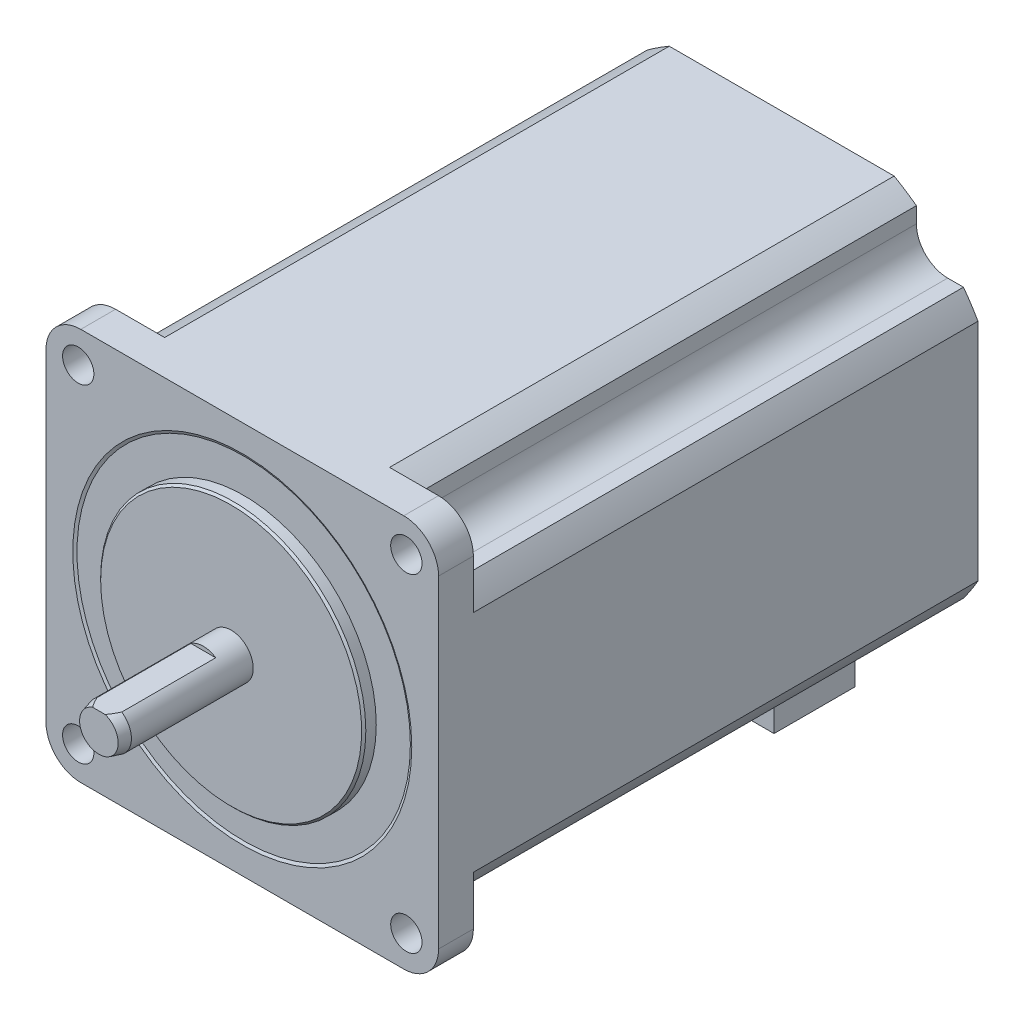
ISO-10303-21;
HEADER;
FILE_DESCRIPTION(('STEP AP214'),'2;1');
FILE_NAME('part.step','',(''),(''),'','','');
FILE_SCHEMA(('AUTOMOTIVE_DESIGN { 1 0 10303 214 1 1 1 1 }'));
ENDSEC;
DATA;
#1=APPLICATION_CONTEXT('core data for automotive mechanical design processes');
#2=APPLICATION_PROTOCOL_DEFINITION('international standard','automotive_design',2000,#1);
#3=PRODUCT_CONTEXT('',#1,'mechanical');
#4=PRODUCT('Part','Part','',(#3));
#5=PRODUCT_RELATED_PRODUCT_CATEGORY('part','',(#4));
#6=PRODUCT_DEFINITION_FORMATION('','',#4);
#7=PRODUCT_DEFINITION_CONTEXT('part definition',#1,'design');
#8=PRODUCT_DEFINITION('design','',#6,#7);
#9=PRODUCT_DEFINITION_SHAPE('','',#8);
#10=(LENGTH_UNIT() NAMED_UNIT(*) SI_UNIT(.MILLI.,.METRE.));
#11=(NAMED_UNIT(*) PLANE_ANGLE_UNIT() SI_UNIT($,.RADIAN.));
#12=(NAMED_UNIT(*) SI_UNIT($,.STERADIAN.) SOLID_ANGLE_UNIT());
#13=UNCERTAINTY_MEASURE_WITH_UNIT(LENGTH_MEASURE(1.E-05),#10,'distance_accuracy_value','');
#14=(GEOMETRIC_REPRESENTATION_CONTEXT(3) GLOBAL_UNCERTAINTY_ASSIGNED_CONTEXT((#13)) GLOBAL_UNIT_ASSIGNED_CONTEXT((#10,
#11,#12)) REPRESENTATION_CONTEXT('',''));
#15=CARTESIAN_POINT('',(0.,0.,0.));
#16=DIRECTION('',(0.,0.,1.));
#17=DIRECTION('',(1.,0.,0.));
#18=AXIS2_PLACEMENT_3D('',#15,#16,#17);
#19=CARTESIAN_POINT('',(0.,0.,-79.1));
#20=DIRECTION('',(0.,0.,-1.));
#21=DIRECTION('',(-1.,0.,0.));
#22=AXIS2_PLACEMENT_3D('',#19,#20,#21);
#23=PLANE('',#22);
#24=DIRECTION('',(0.,1.,0.));
#25=VECTOR('',#24,1.);
#26=CARTESIAN_POINT('',(-28.2,0.,-79.1));
#27=LINE('',#26,#25);
#28=CARTESIAN_POINT('',(-28.2,-16.1558039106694,-79.1));
#29=VERTEX_POINT('',#28);
#30=CARTESIAN_POINT('',(-28.2,16.1558039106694,-79.1));
#31=VERTEX_POINT('',#30);
#32=EDGE_CURVE('E371',#29,#31,#27,.T.);
#33=ORIENTED_EDGE('',*,*,#32,.T.);
#34=CARTESIAN_POINT('',(0.,0.,-79.1));
#35=DIRECTION('',(0.,0.,-1.));
#36=DIRECTION('',(-1.,0.,0.));
#37=AXIS2_PLACEMENT_3D('',#34,#35,#36);
#38=CIRCLE('',#37,32.5);
#39=CARTESIAN_POINT('',(-26.1118268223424,19.35,-79.1));
#40=VERTEX_POINT('',#39);
#41=EDGE_CURVE('E374',#31,#40,#38,.T.);
#42=ORIENTED_EDGE('',*,*,#41,.T.);
#43=DIRECTION('',(-1.,0.,0.));
#44=VECTOR('',#43,1.);
#45=CARTESIAN_POINT('',(0.,19.3500000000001,-79.1));
#46=LINE('',#45,#44);
#47=CARTESIAN_POINT('',(-23.85,19.35,-79.1));
#48=VERTEX_POINT('',#47);
#49=EDGE_CURVE('E378',#48,#40,#46,.T.);
#50=ORIENTED_EDGE('',*,*,#49,.F.);
#51=CARTESIAN_POINT('',(-23.85,23.85,-79.1));
#52=DIRECTION('',(0.,0.,-1.));
#53=DIRECTION('',(-1.,0.,0.));
#54=AXIS2_PLACEMENT_3D('',#51,#52,#53);
#55=CIRCLE('',#54,4.5);
#56=CARTESIAN_POINT('',(-19.35,23.85,-79.1));
#57=VERTEX_POINT('',#56);
#58=EDGE_CURVE('E502',#48,#57,#55,.F.);
#59=ORIENTED_EDGE('',*,*,#58,.T.);
#60=DIRECTION('',(0.,-1.,0.));
#61=VECTOR('',#60,1.);
#62=CARTESIAN_POINT('',(-19.35,0.,-79.1));
#63=LINE('',#62,#61);
#64=CARTESIAN_POINT('',(-19.35,26.1118268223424,-79.1));
#65=VERTEX_POINT('',#64);
#66=EDGE_CURVE('E382',#65,#57,#63,.T.);
#67=ORIENTED_EDGE('',*,*,#66,.F.);
#68=CARTESIAN_POINT('',(-16.1558039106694,28.2,-79.1));
#69=VERTEX_POINT('',#68);
#70=EDGE_CURVE('E380',#65,#69,#38,.T.);
#71=ORIENTED_EDGE('',*,*,#70,.T.);
#72=DIRECTION('',(1.,0.,0.));
#73=VECTOR('',#72,1.);
#74=CARTESIAN_POINT('',(0.,28.2,-79.1));
#75=LINE('',#74,#73);
#76=CARTESIAN_POINT('',(16.1558039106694,28.2,-79.1));
#77=VERTEX_POINT('',#76);
#78=EDGE_CURVE('E385',#69,#77,#75,.T.);
#79=ORIENTED_EDGE('',*,*,#78,.T.);
#80=CARTESIAN_POINT('',(19.35,26.1118268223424,-79.1));
#81=VERTEX_POINT('',#80);
#82=EDGE_CURVE('E387',#77,#81,#38,.T.);
#83=ORIENTED_EDGE('',*,*,#82,.T.);
#84=DIRECTION('',(0.,-1.,0.));
#85=VECTOR('',#84,1.);
#86=CARTESIAN_POINT('',(19.35,0.,-79.1));
#87=LINE('',#86,#85);
#88=CARTESIAN_POINT('',(19.35,23.85,-79.1));
#89=VERTEX_POINT('',#88);
#90=EDGE_CURVE('E388',#81,#89,#87,.T.);
#91=ORIENTED_EDGE('',*,*,#90,.T.);
#92=CARTESIAN_POINT('',(23.85,23.85,-79.1));
#93=DIRECTION('',(0.,0.,-1.));
#94=DIRECTION('',(-1.,0.,0.));
#95=AXIS2_PLACEMENT_3D('',#92,#93,#94);
#96=CIRCLE('',#95,4.5);
#97=CARTESIAN_POINT('',(23.85,19.35,-79.1));
#98=VERTEX_POINT('',#97);
#99=EDGE_CURVE('E504',#89,#98,#96,.F.);
#100=ORIENTED_EDGE('',*,*,#99,.T.);
#101=DIRECTION('',(-1.,0.,0.));
#102=VECTOR('',#101,1.);
#103=CARTESIAN_POINT('',(0.,19.3500000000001,-79.1));
#104=LINE('',#103,#102);
#105=CARTESIAN_POINT('',(26.1118268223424,19.35,-79.1));
#106=VERTEX_POINT('',#105);
#107=EDGE_CURVE('E391',#106,#98,#104,.T.);
#108=ORIENTED_EDGE('',*,*,#107,.F.);
#109=CARTESIAN_POINT('',(28.2,16.1558039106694,-79.1));
#110=VERTEX_POINT('',#109);
#111=EDGE_CURVE('E394',#106,#110,#38,.T.);
#112=ORIENTED_EDGE('',*,*,#111,.T.);
#113=DIRECTION('',(0.,-1.,0.));
#114=VECTOR('',#113,1.);
#115=CARTESIAN_POINT('',(28.2,0.,-79.1));
#116=LINE('',#115,#114);
#117=CARTESIAN_POINT('',(28.2,-16.1558039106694,-79.1));
#118=VERTEX_POINT('',#117);
#119=EDGE_CURVE('E395',#110,#118,#116,.T.);
#120=ORIENTED_EDGE('',*,*,#119,.T.);
#121=CARTESIAN_POINT('',(26.1118268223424,-19.35,-79.1));
#122=VERTEX_POINT('',#121);
#123=EDGE_CURVE('E397',#118,#122,#38,.T.);
#124=ORIENTED_EDGE('',*,*,#123,.T.);
#125=DIRECTION('',(-1.,0.,0.));
#126=VECTOR('',#125,1.);
#127=CARTESIAN_POINT('',(0.,-19.3499999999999,-79.1));
#128=LINE('',#127,#126);
#129=CARTESIAN_POINT('',(23.85,-19.35,-79.1));
#130=VERTEX_POINT('',#129);
#131=EDGE_CURVE('E398',#122,#130,#128,.T.);
#132=ORIENTED_EDGE('',*,*,#131,.T.);
#133=CARTESIAN_POINT('',(23.85,-23.85,-79.1));
#134=DIRECTION('',(0.,0.,-1.));
#135=DIRECTION('',(-1.,0.,0.));
#136=AXIS2_PLACEMENT_3D('',#133,#134,#135);
#137=CIRCLE('',#136,4.5);
#138=CARTESIAN_POINT('',(19.35,-23.85,-79.1));
#139=VERTEX_POINT('',#138);
#140=EDGE_CURVE('E498',#130,#139,#137,.F.);
#141=ORIENTED_EDGE('',*,*,#140,.T.);
#142=DIRECTION('',(0.,-1.,0.));
#143=VECTOR('',#142,1.);
#144=CARTESIAN_POINT('',(19.35,0.,-79.1));
#145=LINE('',#144,#143);
#146=CARTESIAN_POINT('',(19.35,-26.1118268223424,-79.1));
#147=VERTEX_POINT('',#146);
#148=EDGE_CURVE('E401',#139,#147,#145,.T.);
#149=ORIENTED_EDGE('',*,*,#148,.T.);
#150=CARTESIAN_POINT('',(16.1558039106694,-28.2,-79.1));
#151=VERTEX_POINT('',#150);
#152=EDGE_CURVE('E403',#147,#151,#38,.T.);
#153=ORIENTED_EDGE('',*,*,#152,.T.);
#154=DIRECTION('',(-1.,0.,0.));
#155=VECTOR('',#154,1.);
#156=CARTESIAN_POINT('',(0.,-28.2,-79.1));
#157=LINE('',#156,#155);
#158=CARTESIAN_POINT('',(10.5,-28.2,-79.1));
#159=VERTEX_POINT('',#158);
#160=EDGE_CURVE('E404',#151,#159,#157,.T.);
#161=ORIENTED_EDGE('',*,*,#160,.T.);
#162=DIRECTION('',(0.,1.,0.));
#163=VECTOR('',#162,1.);
#164=CARTESIAN_POINT('',(10.5,-38.2,-79.1));
#165=LINE('',#164,#163);
#166=CARTESIAN_POINT('',(10.5,-38.2,-79.1));
#167=VERTEX_POINT('',#166);
#168=EDGE_CURVE('E365',#167,#159,#165,.T.);
#169=ORIENTED_EDGE('',*,*,#168,.F.);
#170=DIRECTION('',(1.,0.,0.));
#171=VECTOR('',#170,1.);
#172=CARTESIAN_POINT('',(-10.5,-38.2,-79.1));
#173=LINE('',#172,#171);
#174=CARTESIAN_POINT('',(-10.5,-38.2,-79.1));
#175=VERTEX_POINT('',#174);
#176=EDGE_CURVE('E348',#175,#167,#173,.T.);
#177=ORIENTED_EDGE('',*,*,#176,.F.);
#178=DIRECTION('',(0.,1.,0.));
#179=VECTOR('',#178,1.);
#180=CARTESIAN_POINT('',(-10.5,-38.2,-79.1));
#181=LINE('',#180,#179);
#182=CARTESIAN_POINT('',(-10.5,-28.2,-79.1));
#183=VERTEX_POINT('',#182);
#184=EDGE_CURVE('E367',#175,#183,#181,.T.);
#185=ORIENTED_EDGE('',*,*,#184,.T.);
#186=CARTESIAN_POINT('',(-16.1558039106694,-28.2,-79.1));
#187=VERTEX_POINT('',#186);
#188=EDGE_CURVE('E408',#183,#187,#157,.T.);
#189=ORIENTED_EDGE('',*,*,#188,.T.);
#190=CARTESIAN_POINT('',(-19.35,-26.1118268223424,-79.1));
#191=VERTEX_POINT('',#190);
#192=EDGE_CURVE('E407',#187,#191,#38,.T.);
#193=ORIENTED_EDGE('',*,*,#192,.T.);
#194=DIRECTION('',(0.,-1.,0.));
#195=VECTOR('',#194,1.);
#196=CARTESIAN_POINT('',(-19.35,0.,-79.1));
#197=LINE('',#196,#195);
#198=CARTESIAN_POINT('',(-19.35,-23.85,-79.1));
#199=VERTEX_POINT('',#198);
#200=EDGE_CURVE('E409',#199,#191,#197,.T.);
#201=ORIENTED_EDGE('',*,*,#200,.F.);
#202=CARTESIAN_POINT('',(-23.85,-23.85,-79.1));
#203=DIRECTION('',(0.,0.,-1.));
#204=DIRECTION('',(-1.,0.,0.));
#205=AXIS2_PLACEMENT_3D('',#202,#203,#204);
#206=CIRCLE('',#205,4.5);
#207=CARTESIAN_POINT('',(-23.85,-19.35,-79.1));
#208=VERTEX_POINT('',#207);
#209=EDGE_CURVE('E500',#199,#208,#206,.F.);
#210=ORIENTED_EDGE('',*,*,#209,.T.);
#211=DIRECTION('',(-1.,0.,0.));
#212=VECTOR('',#211,1.);
#213=CARTESIAN_POINT('',(0.,-19.35,-79.1));
#214=LINE('',#213,#212);
#215=CARTESIAN_POINT('',(-26.1118268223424,-19.35,-79.1));
#216=VERTEX_POINT('',#215);
#217=EDGE_CURVE('E411',#208,#216,#214,.T.);
#218=ORIENTED_EDGE('',*,*,#217,.T.);
#219=EDGE_CURVE('E379',#216,#29,#38,.T.);
#220=ORIENTED_EDGE('',*,*,#219,.T.);
#221=EDGE_LOOP('',(#33,#42,#50,#59,#67,#71,#79,#83,#91,#100,#108,#112,#120,#124,#132,#141,#149,
#153,#161,#169,#177,#185,#189,#193,#201,#210,#218,#220));
#222=FACE_BOUND('',#221,.T.);
#223=CARTESIAN_POINT('',(0.,0.,-79.1));
#224=DIRECTION('',(0.,0.,-1.));
#225=DIRECTION('',(-1.,0.,0.));
#226=AXIS2_PLACEMENT_3D('',#223,#224,#225);
#227=CIRCLE('',#226,3.175);
#228=CARTESIAN_POINT('',(-3.175,0.,-79.1));
#229=VERTEX_POINT('',#228);
#230=EDGE_CURVE('E311',#229,#229,#227,.T.);
#231=ORIENTED_EDGE('',*,*,#230,.F.);
#232=EDGE_LOOP('',(#231));
#233=FACE_BOUND('',#232,.T.);
#234=ADVANCED_FACE('F39',(#222,#233),#23,.T.);
#235=CARTESIAN_POINT('',(0.,0.,19.));
#236=DIRECTION('',(0.,0.,-1.));
#237=DIRECTION('',(-1.,0.,0.));
#238=AXIS2_PLACEMENT_3D('',#235,#236,#237);
#239=CYLINDRICAL_SURFACE('',#238,3.175);
#240=CARTESIAN_POINT('',(0.,0.,17.4999999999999));
#241=DIRECTION('',(0.,0.,1.));
#242=DIRECTION('',(1.,0.,0.));
#243=AXIS2_PLACEMENT_3D('',#240,#241,#242);
#244=CIRCLE('',#243,3.175);
#245=CARTESIAN_POINT('',(1.78605710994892,2.625,17.5000000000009));
#246=VERTEX_POINT('',#245);
#247=CARTESIAN_POINT('',(-1.78605710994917,2.625,17.4999999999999));
#248=VERTEX_POINT('',#247);
#249=EDGE_CURVE('E509',#246,#248,#244,.F.);
#250=ORIENTED_EDGE('',*,*,#249,.T.);
#251=DIRECTION('',(0.,0.,-1.));
#252=VECTOR('',#251,1.);
#253=CARTESIAN_POINT('',(-1.78605710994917,2.625,19.));
#254=LINE('',#253,#252);
#255=CARTESIAN_POINT('',(-1.78605710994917,2.625,4.));
#256=VERTEX_POINT('',#255);
#257=EDGE_CURVE('E341',#248,#256,#254,.T.);
#258=ORIENTED_EDGE('',*,*,#257,.T.);
#259=CARTESIAN_POINT('',(0.,0.,4.));
#260=DIRECTION('',(0.,0.,1.));
#261=DIRECTION('',(1.,0.,0.));
#262=AXIS2_PLACEMENT_3D('',#259,#260,#261);
#263=CIRCLE('',#262,3.175);
#264=CARTESIAN_POINT('',(1.78605710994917,2.625,4.));
#265=VERTEX_POINT('',#264);
#266=EDGE_CURVE('E520',#265,#256,#263,.T.);
#267=ORIENTED_EDGE('',*,*,#266,.F.);
#268=DIRECTION('',(0.,0.,-1.));
#269=VECTOR('',#268,1.);
#270=CARTESIAN_POINT('',(1.78605710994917,2.625,19.));
#271=LINE('',#270,#269);
#272=EDGE_CURVE('E337',#265,#246,#271,.F.);
#273=ORIENTED_EDGE('',*,*,#272,.T.);
#274=EDGE_LOOP('',(#250,#258,#267,#273));
#275=FACE_BOUND('',#274,.T.);
#276=CARTESIAN_POINT('',(0.,0.,0.));
#277=DIRECTION('',(0.,0.,-1.));
#278=DIRECTION('',(-1.,0.,0.));
#279=AXIS2_PLACEMENT_3D('',#276,#277,#278);
#280=CIRCLE('',#279,3.175);
#281=CARTESIAN_POINT('',(-3.175,0.,0.));
#282=VERTEX_POINT('',#281);
#283=EDGE_CURVE('E808',#282,#282,#280,.T.);
#284=ORIENTED_EDGE('',*,*,#283,.F.);
#285=EDGE_LOOP('',(#284));
#286=FACE_BOUND('',#285,.T.);
#287=ADVANCED_FACE('F557',(#275,#286),#239,.T.);
#288=CARTESIAN_POINT('',(0.,0.,19.));
#289=DIRECTION('',(0.,0.,1.));
#290=DIRECTION('',(1.,0.,0.));
#291=AXIS2_PLACEMENT_3D('',#288,#289,#290);
#292=PLANE('',#291);
#293=DIRECTION('',(1.,0.,0.));
#294=VECTOR('',#293,1.);
#295=CARTESIAN_POINT('',(-4.72781232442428,2.625,19.));
#296=LINE('',#295,#294);
#297=CARTESIAN_POINT('',(-0.894050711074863,2.625,19.));
#298=VERTEX_POINT('',#297);
#299=CARTESIAN_POINT('',(0.894050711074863,2.625,19.));
#300=VERTEX_POINT('',#299);
#301=EDGE_CURVE('E333',#298,#300,#296,.T.);
#302=ORIENTED_EDGE('',*,*,#301,.F.);
#303=CARTESIAN_POINT('',(0.,0.,19.));
#304=DIRECTION('',(0.,0.,1.));
#305=DIRECTION('',(1.,0.,0.));
#306=AXIS2_PLACEMENT_3D('',#303,#304,#305);
#307=CIRCLE('',#306,2.77307621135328);
#308=EDGE_CURVE('E506',#298,#300,#307,.T.);
#309=ORIENTED_EDGE('',*,*,#308,.T.);
#310=EDGE_LOOP('',(#302,#309));
#311=FACE_BOUND('',#310,.T.);
#312=ADVANCED_FACE('F652',(#311),#292,.T.);
#313=CARTESIAN_POINT('',(0.,0.,0.));
#314=DIRECTION('',(0.,0.,-1.));
#315=DIRECTION('',(-1.,0.,0.));
#316=AXIS2_PLACEMENT_3D('',#313,#314,#315);
#317=PLANE('',#316);
#318=CARTESIAN_POINT('',(0.,0.,0.));
#319=DIRECTION('',(0.,0.,-1.));
#320=DIRECTION('',(-1.,0.,0.));
#321=AXIS2_PLACEMENT_3D('',#318,#319,#320);
#322=CIRCLE('',#321,18.75);
#323=CARTESIAN_POINT('',(-18.75,0.,0.));
#324=VERTEX_POINT('',#323);
#325=EDGE_CURVE('E1361',#324,#324,#322,.F.);
#326=ORIENTED_EDGE('',*,*,#325,.T.);
#327=EDGE_LOOP('',(#326));
#328=FACE_BOUND('',#327,.T.);
#329=ORIENTED_EDGE('',*,*,#283,.T.);
#330=EDGE_LOOP('',(#329));
#331=FACE_BOUND('',#330,.T.);
#332=ADVANCED_FACE('F648',(#328,#331),#317,.F.);
#333=CARTESIAN_POINT('',(0.,0.,-1.6));
#334=DIRECTION('',(0.,0.,1.));
#335=DIRECTION('',(1.,0.,0.));
#336=AXIS2_PLACEMENT_3D('',#333,#334,#335);
#337=CYLINDRICAL_SURFACE('',#336,19.05);
#338=CARTESIAN_POINT('',(0.,0.,-0.299999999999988));
#339=DIRECTION('',(0.,0.,-1.));
#340=DIRECTION('',(-1.,0.,0.));
#341=AXIS2_PLACEMENT_3D('',#338,#339,#340);
#342=CIRCLE('',#341,19.05);
#343=CARTESIAN_POINT('',(-19.05,0.,-0.299999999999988));
#344=VERTEX_POINT('',#343);
#345=EDGE_CURVE('E1364',#344,#344,#342,.T.);
#346=ORIENTED_EDGE('',*,*,#345,.T.);
#347=EDGE_LOOP('',(#346));
#348=FACE_BOUND('',#347,.T.);
#349=CARTESIAN_POINT('',(0.,0.,-1.8));
#350=DIRECTION('',(0.,0.,1.));
#351=DIRECTION('',(1.,0.,0.));
#352=AXIS2_PLACEMENT_3D('',#349,#350,#351);
#353=CIRCLE('',#352,19.05);
#354=CARTESIAN_POINT('',(19.05,0.,-1.8));
#355=VERTEX_POINT('',#354);
#356=EDGE_CURVE('E327',#355,#355,#353,.T.);
#357=ORIENTED_EDGE('',*,*,#356,.T.);
#358=EDGE_LOOP('',(#357));
#359=FACE_BOUND('',#358,.T.);
#360=ADVANCED_FACE('F651',(#348,#359),#337,.T.);
#361=CARTESIAN_POINT('',(0.,0.,19.));
#362=DIRECTION('',(0.,0.,-1.));
#363=DIRECTION('',(-1.,0.,0.));
#364=AXIS2_PLACEMENT_3D('',#361,#362,#363);
#365=CONICAL_SURFACE('',#364,2.77307621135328,0.261799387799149);
#366=CARTESIAN_POINT('',(-3.30935894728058,2.625,13.5849436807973));
#367=CARTESIAN_POINT('',(-3.24542473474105,2.625,13.7718399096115));
#368=CARTESIAN_POINT('',(-3.18087365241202,2.625,13.9585279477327));
#369=CARTESIAN_POINT('',(-3.05023975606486,2.625,14.331388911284));
#370=CARTESIAN_POINT('',(-2.98415678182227,2.625,14.5175617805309));
#371=CARTESIAN_POINT('',(-2.85014549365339,2.625,14.8893346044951));
#372=CARTESIAN_POINT('',(-2.78221639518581,2.625,15.0749342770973));
#373=CARTESIAN_POINT('',(-2.64413585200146,2.625,15.4452951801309));
#374=CARTESIAN_POINT('',(-2.57398453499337,2.625,15.6300564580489));
#375=CARTESIAN_POINT('',(-2.43088450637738,2.625,15.9985625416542));
#376=CARTESIAN_POINT('',(-2.35793492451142,2.625,16.1823070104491));
#377=CARTESIAN_POINT('',(-2.20847433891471,2.625,16.5483836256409));
#378=CARTESIAN_POINT('',(-2.13196278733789,2.625,16.7307155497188));
#379=CARTESIAN_POINT('',(-1.9741229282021,2.625,17.0936282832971));
#380=CARTESIAN_POINT('',(-1.89278731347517,2.625,17.2742059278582));
#381=CARTESIAN_POINT('',(-1.72367545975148,2.625,17.6322943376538));
#382=CARTESIAN_POINT('',(-1.63590163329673,2.625,17.8098062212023));
#383=CARTESIAN_POINT('',(-1.49689402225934,2.625,18.0727010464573));
#384=CARTESIAN_POINT('',(-1.44921905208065,2.625,18.1599613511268));
#385=CARTESIAN_POINT('',(-1.35081442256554,2.625,18.3328001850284));
#386=CARTESIAN_POINT('',(-1.30008362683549,2.625,18.4183780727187));
#387=CARTESIAN_POINT('',(-1.19492866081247,2.625,18.5868191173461));
#388=CARTESIAN_POINT('',(-1.14051856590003,2.625,18.669691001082));
#389=CARTESIAN_POINT('',(-1.02665023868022,2.625,18.8318604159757));
#390=CARTESIAN_POINT('',(-0.967196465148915,2.625,18.9111610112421));
#391=CARTESIAN_POINT('',(-0.86224269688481,2.625,19.0387203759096));
#392=CARTESIAN_POINT('',(-0.818661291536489,2.625,19.0885458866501));
#393=CARTESIAN_POINT('',(-0.72751356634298,2.625,19.1846578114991));
#394=CARTESIAN_POINT('',(-0.679939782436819,2.625,19.2309372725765));
#395=CARTESIAN_POINT('',(-0.579402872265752,2.625,19.3185048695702));
#396=CARTESIAN_POINT('',(-0.52638729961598,2.625,19.3597339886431));
#397=CARTESIAN_POINT('',(-0.41450792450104,2.625,19.4333493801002));
#398=CARTESIAN_POINT('',(-0.355665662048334,2.625,19.4657666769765));
#399=CARTESIAN_POINT('',(-0.254920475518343,2.625,19.5076037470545));
#400=CARTESIAN_POINT('',(-0.214733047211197,2.625,19.5210971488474));
#401=CARTESIAN_POINT('',(-0.132696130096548,2.625,19.5413023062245));
#402=CARTESIAN_POINT('',(-0.0908493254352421,2.625,19.5480245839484));
#403=CARTESIAN_POINT('',(-0.00641419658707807,2.625,19.5538691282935));
#404=CARTESIAN_POINT('',(0.036176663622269,2.625,19.5529560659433));
#405=CARTESIAN_POINT('',(0.120530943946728,2.625,19.5435732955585));
#406=CARTESIAN_POINT('',(0.162293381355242,2.625,19.5350951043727));
#407=CARTESIAN_POINT('',(0.254092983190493,2.625,19.5086701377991));
#408=CARTESIAN_POINT('',(0.303590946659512,2.625,19.4888870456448));
#409=CARTESIAN_POINT('',(0.398827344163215,2.625,19.4417789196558));
#410=CARTESIAN_POINT('',(0.444557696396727,2.625,19.4144381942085));
#411=CARTESIAN_POINT('',(0.528152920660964,2.625,19.3573624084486));
#412=CARTESIAN_POINT('',(0.56635190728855,2.625,19.3281050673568));
#413=CARTESIAN_POINT('',(0.640136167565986,2.625,19.2664333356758));
#414=CARTESIAN_POINT('',(0.675718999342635,2.625,19.2340160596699));
#415=CARTESIAN_POINT('',(0.744720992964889,2.625,19.1667643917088));
#416=CARTESIAN_POINT('',(0.778132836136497,2.625,19.1319225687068));
#417=CARTESIAN_POINT('',(0.842993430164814,2.625,19.0605004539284));
#418=CARTESIAN_POINT('',(0.874443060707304,2.625,19.0239209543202));
#419=CARTESIAN_POINT('',(0.960526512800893,2.625,18.9192141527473));
#420=CARTESIAN_POINT('',(1.01328788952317,2.625,18.8495504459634));
#421=CARTESIAN_POINT('',(1.11474355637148,2.625,18.7073019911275));
#422=CARTESIAN_POINT('',(1.16343498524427,2.625,18.6347152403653));
#423=CARTESIAN_POINT('',(1.25772470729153,2.625,18.4873519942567));
#424=CARTESIAN_POINT('',(1.30331615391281,2.625,18.4125711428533));
#425=CARTESIAN_POINT('',(1.3919413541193,2.625,18.2615031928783));
#426=CARTESIAN_POINT('',(1.4349746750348,2.625,18.1852158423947));
#427=CARTESIAN_POINT('',(1.56162993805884,2.625,17.953462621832));
#428=CARTESIAN_POINT('',(1.64208680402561,2.625,17.7962698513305));
#429=CARTESIAN_POINT('',(1.79705705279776,2.625,17.4792970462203));
#430=CARTESIAN_POINT('',(1.8715784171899,2.625,17.3195208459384));
#431=CARTESIAN_POINT('',(2.01054641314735,2.625,17.0108615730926));
#432=CARTESIAN_POINT('',(2.07532251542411,2.625,16.862126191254));
#433=CARTESIAN_POINT('',(2.20202359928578,2.625,16.5634427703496));
#434=CARTESIAN_POINT('',(2.26394842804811,2.625,16.4134946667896));
#435=CARTESIAN_POINT('',(2.44641955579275,2.625,15.9620477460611));
#436=CARTESIAN_POINT('',(2.56356197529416,2.625,15.6591749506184));
#437=CARTESIAN_POINT('',(2.78774888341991,2.625,15.0616544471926));
#438=CARTESIAN_POINT('',(2.89500244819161,2.625,14.7670842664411));
#439=CARTESIAN_POINT('',(3.0526461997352,2.625,14.3242983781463));
#440=CARTESIAN_POINT('',(3.10462177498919,2.625,14.1766447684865));
#441=CARTESIAN_POINT('',(3.20764960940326,2.625,13.8810202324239));
#442=CARTESIAN_POINT('',(3.25870189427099,2.625,13.7330493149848));
#443=CARTESIAN_POINT('',(3.30935894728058,2.625,13.5849436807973));
#444=B_SPLINE_CURVE_WITH_KNOTS('',3,(#366,#367,#368,#369,#370,#371,#372,#373,#374,#375,#376,
#377,#378,#379,#380,#381,#382,#383,#384,#385,#386,#387,#388,#389,#390,#391,#392,#393,#394,#395,
#396,#397,#398,#399,#400,#401,#402,#403,#404,#405,#406,#407,#408,#409,#410,#411,#412,#413,#414,
#415,#416,#417,#418,#419,#420,#421,#422,#423,#424,#425,#426,#427,#428,#429,#430,#431,#432,#433,
#434,#435,#436,#437,#438,#439,#440,#441,#442,#443),.UNSPECIFIED.,.F.,.F.,(4,2,2,2,2,2,2,2,2,2,2,
2,2,2,2,2,2,2,2,2,2,2,2,2,2,2,2,2,2,2,2,2,2,2,2,2,2,2,4),(0.,0.592590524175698,1.18524331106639,
1.77815202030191,2.37102671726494,2.96408731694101,3.55723943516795,4.15131417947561,
4.74516743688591,5.04342777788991,5.34179972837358,5.63908859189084,5.93611732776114,
6.13455567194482,6.33337364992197,6.53432931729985,6.73456801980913,6.86126706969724,
6.98776892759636,7.11485643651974,7.24208663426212,7.40110146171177,7.56044895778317,
7.70458491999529,7.84885375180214,7.99358608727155,8.13825306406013,8.4001916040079,
8.66231276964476,8.92499521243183,9.18772195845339,9.71727649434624,10.2461064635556,
10.7327538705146,11.219427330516,12.1935231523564,13.1339513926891,13.6035521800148,
14.0731398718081),.UNSPECIFIED.);
#445=EDGE_CURVE('E519',#248,#298,#444,.T.);
#446=ORIENTED_EDGE('',*,*,#445,.F.);
#447=ORIENTED_EDGE('',*,*,#249,.F.);
#448=EDGE_CURVE('E512',#300,#246,#444,.T.);
#449=ORIENTED_EDGE('',*,*,#448,.F.);
#450=ORIENTED_EDGE('',*,*,#308,.F.);
#451=EDGE_LOOP('',(#446,#447,#449,#450));
#452=FACE_BOUND('',#451,.T.);
#453=ADVANCED_FACE('F522',(#452),#365,.T.);
#454=CARTESIAN_POINT('',(0.,0.,4.));
#455=DIRECTION('',(0.,0.,1.));
#456=DIRECTION('',(1.,0.,0.));
#457=AXIS2_PLACEMENT_3D('',#454,#455,#456);
#458=PLANE('',#457);
#459=ORIENTED_EDGE('',*,*,#266,.T.);
#460=DIRECTION('',(1.,0.,0.));
#461=VECTOR('',#460,1.);
#462=CARTESIAN_POINT('',(-4.72781232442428,2.625,4.));
#463=LINE('',#462,#461);
#464=EDGE_CURVE('E334',#256,#265,#463,.T.);
#465=ORIENTED_EDGE('',*,*,#464,.T.);
#466=EDGE_LOOP('',(#459,#465));
#467=FACE_BOUND('',#466,.T.);
#468=ADVANCED_FACE('F532',(#467),#458,.T.);
#469=CARTESIAN_POINT('',(-4.72781232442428,2.625,4.));
#470=DIRECTION('',(0.,-1.,0.));
#471=DIRECTION('',(0.,0.,-1.));
#472=AXIS2_PLACEMENT_3D('',#469,#470,#471);
#473=PLANE('',#472);
#474=ORIENTED_EDGE('',*,*,#445,.T.);
#475=ORIENTED_EDGE('',*,*,#301,.T.);
#476=ORIENTED_EDGE('',*,*,#448,.T.);
#477=ORIENTED_EDGE('',*,*,#272,.F.);
#478=ORIENTED_EDGE('',*,*,#464,.F.);
#479=ORIENTED_EDGE('',*,*,#257,.F.);
#480=EDGE_LOOP('',(#474,#475,#476,#477,#478,#479));
#481=FACE_BOUND('',#480,.T.);
#482=ADVANCED_FACE('F526',(#481),#473,.F.);
#483=CARTESIAN_POINT('',(0.,0.,-1.8));
#484=DIRECTION('',(0.,0.,1.));
#485=DIRECTION('',(1.,0.,0.));
#486=AXIS2_PLACEMENT_3D('',#483,#484,#485);
#487=PLANE('',#486);
#488=CARTESIAN_POINT('',(0.,0.,-1.8));
#489=DIRECTION('',(0.,0.,1.));
#490=DIRECTION('',(1.,0.,0.));
#491=AXIS2_PLACEMENT_3D('',#488,#489,#490);
#492=CIRCLE('',#491,23.95);
#493=CARTESIAN_POINT('',(23.95,0.,-1.8));
#494=VERTEX_POINT('',#493);
#495=EDGE_CURVE('E1366',#494,#494,#492,.T.);
#496=ORIENTED_EDGE('',*,*,#495,.T.);
#497=EDGE_LOOP('',(#496));
#498=FACE_BOUND('',#497,.T.);
#499=ORIENTED_EDGE('',*,*,#356,.F.);
#500=EDGE_LOOP('',(#499));
#501=FACE_BOUND('',#500,.T.);
#502=ADVANCED_FACE('F531',(#498,#501),#487,.T.);
#503=CARTESIAN_POINT('',(0.,-19.35,-79.1));
#504=DIRECTION('',(0.,1.,0.));
#505=DIRECTION('',(-1.,0.,0.));
#506=AXIS2_PLACEMENT_3D('',#503,#504,#505);
#507=PLANE('',#506);
#508=ORIENTED_EDGE('',*,*,#217,.F.);
#509=DIRECTION('',(0.,0.,1.));
#510=VECTOR('',#509,1.);
#511=CARTESIAN_POINT('',(-23.85,-19.35,-79.1));
#512=LINE('',#511,#510);
#513=CARTESIAN_POINT('',(-23.85,-19.35,-6.6));
#514=VERTEX_POINT('',#513);
#515=EDGE_CURVE('E477',#208,#514,#512,.T.);
#516=ORIENTED_EDGE('',*,*,#515,.T.);
#517=DIRECTION('',(-1.,0.,0.));
#518=VECTOR('',#517,1.);
#519=CARTESIAN_POINT('',(0.,-19.35,-6.6));
#520=LINE('',#519,#518);
#521=CARTESIAN_POINT('',(-26.1118268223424,-19.35,-6.6));
#522=VERTEX_POINT('',#521);
#523=EDGE_CURVE('E731',#514,#522,#520,.T.);
#524=ORIENTED_EDGE('',*,*,#523,.T.);
#525=DIRECTION('',(0.,0.,1.));
#526=VECTOR('',#525,1.);
#527=CARTESIAN_POINT('',(-26.1118268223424,-19.35,-79.1));
#528=LINE('',#527,#526);
#529=EDGE_CURVE('E718',#216,#522,#528,.T.);
#530=ORIENTED_EDGE('',*,*,#529,.F.);
#531=EDGE_LOOP('',(#508,#516,#524,#530));
#532=FACE_BOUND('',#531,.T.);
#533=ADVANCED_FACE('F566',(#532),#507,.F.);
#534=CARTESIAN_POINT('',(-23.85,-23.85,-79.1));
#535=DIRECTION('',(0.,0.,1.));
#536=DIRECTION('',(1.,0.,0.));
#537=AXIS2_PLACEMENT_3D('',#534,#535,#536);
#538=CYLINDRICAL_SURFACE('',#537,4.5);
#539=ORIENTED_EDGE('',*,*,#209,.F.);
#540=DIRECTION('',(0.,0.,1.));
#541=VECTOR('',#540,1.);
#542=CARTESIAN_POINT('',(-19.35,-23.85,-79.1));
#543=LINE('',#542,#541);
#544=CARTESIAN_POINT('',(-19.35,-23.85,-6.6));
#545=VERTEX_POINT('',#544);
#546=EDGE_CURVE('E482',#545,#199,#543,.F.);
#547=ORIENTED_EDGE('',*,*,#546,.F.);
#548=CARTESIAN_POINT('',(-23.85,-23.85,-6.59999999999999));
#549=DIRECTION('',(0.,0.,-1.));
#550=DIRECTION('',(-1.,0.,0.));
#551=AXIS2_PLACEMENT_3D('',#548,#549,#550);
#552=CIRCLE('',#551,4.5);
#553=EDGE_CURVE('E480',#514,#545,#552,.T.);
#554=ORIENTED_EDGE('',*,*,#553,.F.);
#555=ORIENTED_EDGE('',*,*,#515,.F.);
#556=EDGE_LOOP('',(#539,#547,#554,#555));
#557=FACE_BOUND('',#556,.T.);
#558=ADVANCED_FACE('F569',(#557),#538,.F.);
#559=CARTESIAN_POINT('',(-19.35,0.,-79.1));
#560=DIRECTION('',(-1.,0.,0.));
#561=DIRECTION('',(0.,-1.,0.));
#562=AXIS2_PLACEMENT_3D('',#559,#560,#561);
#563=PLANE('',#562);
#564=DIRECTION('',(0.,-1.,0.));
#565=VECTOR('',#564,1.);
#566=CARTESIAN_POINT('',(-19.35,0.,-6.6));
#567=LINE('',#566,#565);
#568=CARTESIAN_POINT('',(-19.35,-26.1118268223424,-6.6));
#569=VERTEX_POINT('',#568);
#570=EDGE_CURVE('E884',#545,#569,#567,.T.);
#571=ORIENTED_EDGE('',*,*,#570,.F.);
#572=ORIENTED_EDGE('',*,*,#546,.T.);
#573=ORIENTED_EDGE('',*,*,#200,.T.);
#574=DIRECTION('',(0.,0.,1.));
#575=VECTOR('',#574,1.);
#576=CARTESIAN_POINT('',(-19.35,-26.1118268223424,-79.1));
#577=LINE('',#576,#575);
#578=EDGE_CURVE('E722',#191,#569,#577,.T.);
#579=ORIENTED_EDGE('',*,*,#578,.T.);
#580=EDGE_LOOP('',(#571,#572,#573,#579));
#581=FACE_BOUND('',#580,.T.);
#582=ADVANCED_FACE('F571',(#581),#563,.T.);
#583=CARTESIAN_POINT('',(-19.35,0.,-79.1));
#584=DIRECTION('',(-1.,0.,0.));
#585=DIRECTION('',(0.,0.,1.));
#586=AXIS2_PLACEMENT_3D('',#583,#584,#585);
#587=PLANE('',#586);
#588=ORIENTED_EDGE('',*,*,#66,.T.);
#589=DIRECTION('',(0.,0.,1.));
#590=VECTOR('',#589,1.);
#591=CARTESIAN_POINT('',(-19.35,23.85,-6.59999999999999));
#592=LINE('',#591,#590);
#593=CARTESIAN_POINT('',(-19.35,23.85,-6.6));
#594=VERTEX_POINT('',#593);
#595=EDGE_CURVE('E484',#57,#594,#592,.T.);
#596=ORIENTED_EDGE('',*,*,#595,.T.);
#597=DIRECTION('',(0.,-1.,0.));
#598=VECTOR('',#597,1.);
#599=CARTESIAN_POINT('',(-19.35,0.,-6.6));
#600=LINE('',#599,#598);
#601=CARTESIAN_POINT('',(-19.35,26.1118268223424,-6.6));
#602=VERTEX_POINT('',#601);
#603=EDGE_CURVE('E463',#602,#594,#600,.T.);
#604=ORIENTED_EDGE('',*,*,#603,.F.);
#605=DIRECTION('',(0.,0.,1.));
#606=VECTOR('',#605,1.);
#607=CARTESIAN_POINT('',(-19.35,26.1118268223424,-79.1));
#608=LINE('',#607,#606);
#609=EDGE_CURVE('E466',#65,#602,#608,.T.);
#610=ORIENTED_EDGE('',*,*,#609,.F.);
#611=EDGE_LOOP('',(#588,#596,#604,#610));
#612=FACE_BOUND('',#611,.T.);
#613=ADVANCED_FACE('F574',(#612),#587,.T.);
#614=CARTESIAN_POINT('',(-23.85,23.85,-79.1));
#615=DIRECTION('',(0.,0.,-1.));
#616=DIRECTION('',(-1.,0.,0.));
#617=AXIS2_PLACEMENT_3D('',#614,#615,#616);
#618=CYLINDRICAL_SURFACE('',#617,4.5);
#619=ORIENTED_EDGE('',*,*,#58,.F.);
#620=DIRECTION('',(0.,0.,1.));
#621=VECTOR('',#620,1.);
#622=CARTESIAN_POINT('',(-23.85,19.35,-79.1));
#623=LINE('',#622,#621);
#624=CARTESIAN_POINT('',(-23.85,19.35,-6.6));
#625=VERTEX_POINT('',#624);
#626=EDGE_CURVE('E489',#625,#48,#623,.F.);
#627=ORIENTED_EDGE('',*,*,#626,.F.);
#628=CARTESIAN_POINT('',(-23.85,23.85,-6.59999999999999));
#629=DIRECTION('',(0.,0.,-1.));
#630=DIRECTION('',(-1.,0.,0.));
#631=AXIS2_PLACEMENT_3D('',#628,#629,#630);
#632=CIRCLE('',#631,4.5);
#633=EDGE_CURVE('E487',#594,#625,#632,.T.);
#634=ORIENTED_EDGE('',*,*,#633,.F.);
#635=ORIENTED_EDGE('',*,*,#595,.F.);
#636=EDGE_LOOP('',(#619,#627,#634,#635));
#637=FACE_BOUND('',#636,.T.);
#638=ADVANCED_FACE('F594',(#637),#618,.F.);
#639=CARTESIAN_POINT('',(0.,19.3500000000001,-79.1));
#640=DIRECTION('',(0.,1.,0.));
#641=DIRECTION('',(-1.,0.,0.));
#642=AXIS2_PLACEMENT_3D('',#639,#640,#641);
#643=PLANE('',#642);
#644=DIRECTION('',(-1.,0.,0.));
#645=VECTOR('',#644,1.);
#646=CARTESIAN_POINT('',(0.,19.3500000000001,-6.6));
#647=LINE('',#646,#645);
#648=CARTESIAN_POINT('',(-26.1118268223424,19.35,-6.6));
#649=VERTEX_POINT('',#648);
#650=EDGE_CURVE('E415',#625,#649,#647,.T.);
#651=ORIENTED_EDGE('',*,*,#650,.F.);
#652=ORIENTED_EDGE('',*,*,#626,.T.);
#653=ORIENTED_EDGE('',*,*,#49,.T.);
#654=DIRECTION('',(0.,0.,1.));
#655=VECTOR('',#654,1.);
#656=CARTESIAN_POINT('',(-26.1118268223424,19.35,-79.1));
#657=LINE('',#656,#655);
#658=EDGE_CURVE('E746',#40,#649,#657,.T.);
#659=ORIENTED_EDGE('',*,*,#658,.T.);
#660=EDGE_LOOP('',(#651,#652,#653,#659));
#661=FACE_BOUND('',#660,.T.);
#662=ADVANCED_FACE('F539',(#661),#643,.T.);
#663=CARTESIAN_POINT('',(0.,-38.2,0.));
#664=DIRECTION('',(0.,1.,0.));
#665=DIRECTION('',(0.,0.,1.));
#666=AXIS2_PLACEMENT_3D('',#663,#664,#665);
#667=PLANE('',#666);
#668=DIRECTION('',(0.,0.,-1.));
#669=VECTOR('',#668,1.);
#670=CARTESIAN_POINT('',(-10.5,-38.2,-79.1));
#671=LINE('',#670,#669);
#672=CARTESIAN_POINT('',(-10.5,-38.2,-67.5));
#673=VERTEX_POINT('',#672);
#674=EDGE_CURVE('E345',#673,#175,#671,.T.);
#675=ORIENTED_EDGE('',*,*,#674,.T.);
#676=ORIENTED_EDGE('',*,*,#176,.T.);
#677=DIRECTION('',(0.,0.,1.));
#678=VECTOR('',#677,1.);
#679=CARTESIAN_POINT('',(10.5,-38.2,-79.1));
#680=LINE('',#679,#678);
#681=CARTESIAN_POINT('',(10.5,-38.2,-67.5));
#682=VERTEX_POINT('',#681);
#683=EDGE_CURVE('E351',#167,#682,#680,.T.);
#684=ORIENTED_EDGE('',*,*,#683,.T.);
#685=DIRECTION('',(-1.,0.,0.));
#686=VECTOR('',#685,1.);
#687=CARTESIAN_POINT('',(-10.5,-38.2,-67.5));
#688=LINE('',#687,#686);
#689=EDGE_CURVE('E353',#682,#673,#688,.T.);
#690=ORIENTED_EDGE('',*,*,#689,.T.);
#691=EDGE_LOOP('',(#675,#676,#684,#690));
#692=FACE_BOUND('',#691,.T.);
#693=ADVANCED_FACE('F535',(#692),#667,.F.);
#694=CARTESIAN_POINT('',(19.35,0.,-79.1));
#695=DIRECTION('',(-1.,0.,0.));
#696=DIRECTION('',(0.,-1.,0.));
#697=AXIS2_PLACEMENT_3D('',#694,#695,#696);
#698=PLANE('',#697);
#699=DIRECTION('',(0.,-1.,0.));
#700=VECTOR('',#699,1.);
#701=CARTESIAN_POINT('',(19.35,0.,-6.6));
#702=LINE('',#701,#700);
#703=CARTESIAN_POINT('',(19.35,26.1118268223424,-6.6));
#704=VERTEX_POINT('',#703);
#705=CARTESIAN_POINT('',(19.35,23.85,-6.6));
#706=VERTEX_POINT('',#705);
#707=EDGE_CURVE('E452',#704,#706,#702,.T.);
#708=ORIENTED_EDGE('',*,*,#707,.T.);
#709=DIRECTION('',(0.,0.,1.));
#710=VECTOR('',#709,1.);
#711=CARTESIAN_POINT('',(19.35,23.85,-79.1));
#712=LINE('',#711,#710);
#713=EDGE_CURVE('E496',#706,#89,#712,.F.);
#714=ORIENTED_EDGE('',*,*,#713,.T.);
#715=ORIENTED_EDGE('',*,*,#90,.F.);
#716=DIRECTION('',(0.,0.,1.));
#717=VECTOR('',#716,1.);
#718=CARTESIAN_POINT('',(19.35,26.1118268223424,-79.1));
#719=LINE('',#718,#717);
#720=EDGE_CURVE('E459',#81,#704,#719,.T.);
#721=ORIENTED_EDGE('',*,*,#720,.T.);
#722=EDGE_LOOP('',(#708,#714,#715,#721));
#723=FACE_BOUND('',#722,.T.);
#724=ADVANCED_FACE('F538',(#723),#698,.F.);
#725=CARTESIAN_POINT('',(23.85,23.85,-79.1));
#726=DIRECTION('',(0.,0.,1.));
#727=DIRECTION('',(1.,0.,0.));
#728=AXIS2_PLACEMENT_3D('',#725,#726,#727);
#729=CYLINDRICAL_SURFACE('',#728,4.5);
#730=ORIENTED_EDGE('',*,*,#99,.F.);
#731=ORIENTED_EDGE('',*,*,#713,.F.);
#732=CARTESIAN_POINT('',(23.85,23.85,-6.59999999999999));
#733=DIRECTION('',(0.,0.,-1.));
#734=DIRECTION('',(-1.,0.,0.));
#735=AXIS2_PLACEMENT_3D('',#732,#733,#734);
#736=CIRCLE('',#735,4.5);
#737=CARTESIAN_POINT('',(23.85,19.35,-6.6));
#738=VERTEX_POINT('',#737);
#739=EDGE_CURVE('E494',#738,#706,#736,.T.);
#740=ORIENTED_EDGE('',*,*,#739,.F.);
#741=DIRECTION('',(0.,0.,1.));
#742=VECTOR('',#741,1.);
#743=CARTESIAN_POINT('',(23.85,19.35,-79.1));
#744=LINE('',#743,#742);
#745=EDGE_CURVE('E491',#98,#738,#744,.T.);
#746=ORIENTED_EDGE('',*,*,#745,.F.);
#747=EDGE_LOOP('',(#730,#731,#740,#746));
#748=FACE_BOUND('',#747,.T.);
#749=ADVANCED_FACE('F587',(#748),#729,.F.);
#750=CARTESIAN_POINT('',(0.,19.3500000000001,-79.1));
#751=DIRECTION('',(0.,1.,0.));
#752=DIRECTION('',(-1.,0.,0.));
#753=AXIS2_PLACEMENT_3D('',#750,#751,#752);
#754=PLANE('',#753);
#755=ORIENTED_EDGE('',*,*,#107,.T.);
#756=ORIENTED_EDGE('',*,*,#745,.T.);
#757=DIRECTION('',(-1.,0.,0.));
#758=VECTOR('',#757,1.);
#759=CARTESIAN_POINT('',(0.,19.3500000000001,-6.6));
#760=LINE('',#759,#758);
#761=CARTESIAN_POINT('',(26.1118268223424,19.35,-6.6));
#762=VERTEX_POINT('',#761);
#763=EDGE_CURVE('E698',#762,#738,#760,.T.);
#764=ORIENTED_EDGE('',*,*,#763,.F.);
#765=DIRECTION('',(0.,0.,1.));
#766=VECTOR('',#765,1.);
#767=CARTESIAN_POINT('',(26.1118268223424,19.35,-79.1));
#768=LINE('',#767,#766);
#769=EDGE_CURVE('E696',#106,#762,#768,.T.);
#770=ORIENTED_EDGE('',*,*,#769,.F.);
#771=EDGE_LOOP('',(#755,#756,#764,#770));
#772=FACE_BOUND('',#771,.T.);
#773=ADVANCED_FACE('F583',(#772),#754,.T.);
#774=CARTESIAN_POINT('',(0.,-19.3499999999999,-79.1));
#775=DIRECTION('',(0.,1.,0.));
#776=DIRECTION('',(-1.,0.,0.));
#777=AXIS2_PLACEMENT_3D('',#774,#775,#776);
#778=PLANE('',#777);
#779=DIRECTION('',(-1.,0.,0.));
#780=VECTOR('',#779,1.);
#781=CARTESIAN_POINT('',(0.,-19.3499999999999,-6.6));
#782=LINE('',#781,#780);
#783=CARTESIAN_POINT('',(26.1118268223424,-19.35,-6.6));
#784=VERTEX_POINT('',#783);
#785=CARTESIAN_POINT('',(23.85,-19.35,-6.6));
#786=VERTEX_POINT('',#785);
#787=EDGE_CURVE('E885',#784,#786,#782,.T.);
#788=ORIENTED_EDGE('',*,*,#787,.T.);
#789=DIRECTION('',(0.,0.,1.));
#790=VECTOR('',#789,1.);
#791=CARTESIAN_POINT('',(23.85,-19.35,-79.1));
#792=LINE('',#791,#790);
#793=EDGE_CURVE('E475',#786,#130,#792,.F.);
#794=ORIENTED_EDGE('',*,*,#793,.T.);
#795=ORIENTED_EDGE('',*,*,#131,.F.);
#796=DIRECTION('',(0.,0.,1.));
#797=VECTOR('',#796,1.);
#798=CARTESIAN_POINT('',(26.1118268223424,-19.35,-79.1));
#799=LINE('',#798,#797);
#800=EDGE_CURVE('E737',#122,#784,#799,.T.);
#801=ORIENTED_EDGE('',*,*,#800,.T.);
#802=EDGE_LOOP('',(#788,#794,#795,#801));
#803=FACE_BOUND('',#802,.T.);
#804=ADVANCED_FACE('F580',(#803),#778,.F.);
#805=CARTESIAN_POINT('',(23.85,-23.85,-79.1));
#806=DIRECTION('',(0.,0.,-1.));
#807=DIRECTION('',(-1.,0.,0.));
#808=AXIS2_PLACEMENT_3D('',#805,#806,#807);
#809=CYLINDRICAL_SURFACE('',#808,4.5);
#810=ORIENTED_EDGE('',*,*,#140,.F.);
#811=ORIENTED_EDGE('',*,*,#793,.F.);
#812=CARTESIAN_POINT('',(23.85,-23.85,-6.59999999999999));
#813=DIRECTION('',(0.,0.,-1.));
#814=DIRECTION('',(-1.,0.,0.));
#815=AXIS2_PLACEMENT_3D('',#812,#813,#814);
#816=CIRCLE('',#815,4.5);
#817=CARTESIAN_POINT('',(19.35,-23.85,-6.6));
#818=VERTEX_POINT('',#817);
#819=EDGE_CURVE('E472',#818,#786,#816,.T.);
#820=ORIENTED_EDGE('',*,*,#819,.F.);
#821=DIRECTION('',(0.,0.,1.));
#822=VECTOR('',#821,1.);
#823=CARTESIAN_POINT('',(19.35,-23.85,-6.59999999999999));
#824=LINE('',#823,#822);
#825=EDGE_CURVE('E469',#139,#818,#824,.T.);
#826=ORIENTED_EDGE('',*,*,#825,.F.);
#827=EDGE_LOOP('',(#810,#811,#820,#826));
#828=FACE_BOUND('',#827,.T.);
#829=ADVANCED_FACE('F578',(#828),#809,.F.);
#830=CARTESIAN_POINT('',(19.35,0.,-79.1));
#831=DIRECTION('',(-1.,0.,0.));
#832=DIRECTION('',(0.,-1.,0.));
#833=AXIS2_PLACEMENT_3D('',#830,#831,#832);
#834=PLANE('',#833);
#835=ORIENTED_EDGE('',*,*,#148,.F.);
#836=ORIENTED_EDGE('',*,*,#825,.T.);
#837=DIRECTION('',(0.,-1.,0.));
#838=VECTOR('',#837,1.);
#839=CARTESIAN_POINT('',(19.35,0.,-6.6));
#840=LINE('',#839,#838);
#841=CARTESIAN_POINT('',(19.35,-26.1118268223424,-6.6));
#842=VERTEX_POINT('',#841);
#843=EDGE_CURVE('E882',#818,#842,#840,.T.);
#844=ORIENTED_EDGE('',*,*,#843,.T.);
#845=DIRECTION('',(0.,0.,1.));
#846=VECTOR('',#845,1.);
#847=CARTESIAN_POINT('',(19.35,-26.1118268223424,-79.1));
#848=LINE('',#847,#846);
#849=EDGE_CURVE('E734',#147,#842,#848,.T.);
#850=ORIENTED_EDGE('',*,*,#849,.F.);
#851=EDGE_LOOP('',(#835,#836,#844,#850));
#852=FACE_BOUND('',#851,.T.);
#853=ADVANCED_FACE('F563',(#852),#834,.F.);
#854=CARTESIAN_POINT('',(0.,0.,-79.1));
#855=DIRECTION('',(0.,0.,1.));
#856=DIRECTION('',(1.,0.,0.));
#857=AXIS2_PLACEMENT_3D('',#854,#855,#856);
#858=CYLINDRICAL_SURFACE('',#857,32.5);
#859=CARTESIAN_POINT('',(0.,0.,-6.6));
#860=DIRECTION('',(0.,0.,-1.));
#861=DIRECTION('',(-1.,0.,0.));
#862=AXIS2_PLACEMENT_3D('',#859,#860,#861);
#863=CIRCLE('',#862,32.5);
#864=CARTESIAN_POINT('',(-28.2,-16.1558039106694,-6.6));
#865=VERTEX_POINT('',#864);
#866=EDGE_CURVE('E375',#522,#865,#863,.T.);
#867=ORIENTED_EDGE('',*,*,#866,.T.);
#868=DIRECTION('',(0.,0.,1.));
#869=VECTOR('',#868,1.);
#870=CARTESIAN_POINT('',(-28.2,-16.1558039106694,-79.1));
#871=LINE('',#870,#869);
#872=EDGE_CURVE('E714',#29,#865,#871,.T.);
#873=ORIENTED_EDGE('',*,*,#872,.F.);
#874=ORIENTED_EDGE('',*,*,#219,.F.);
#875=ORIENTED_EDGE('',*,*,#529,.T.);
#876=EDGE_LOOP('',(#867,#873,#874,#875));
#877=FACE_BOUND('',#876,.T.);
#878=ADVANCED_FACE('F559',(#877),#858,.T.);
#879=CARTESIAN_POINT('',(-28.2,16.1558039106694,-6.6));
#880=VERTEX_POINT('',#879);
#881=EDGE_CURVE('E370',#880,#649,#863,.T.);
#882=ORIENTED_EDGE('',*,*,#881,.T.);
#883=ORIENTED_EDGE('',*,*,#658,.F.);
#884=ORIENTED_EDGE('',*,*,#41,.F.);
#885=DIRECTION('',(0.,0.,1.));
#886=VECTOR('',#885,1.);
#887=CARTESIAN_POINT('',(-28.2,16.1558039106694,-79.1));
#888=LINE('',#887,#886);
#889=EDGE_CURVE('E749',#31,#880,#888,.T.);
#890=ORIENTED_EDGE('',*,*,#889,.T.);
#891=EDGE_LOOP('',(#882,#883,#884,#890));
#892=FACE_BOUND('',#891,.T.);
#893=ADVANCED_FACE('F562',(#892),#858,.T.);
#894=CARTESIAN_POINT('',(-16.1558039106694,28.2,-6.6));
#895=VERTEX_POINT('',#894);
#896=EDGE_CURVE('E453',#602,#895,#863,.T.);
#897=ORIENTED_EDGE('',*,*,#896,.T.);
#898=DIRECTION('',(0.,0.,1.));
#899=VECTOR('',#898,1.);
#900=CARTESIAN_POINT('',(-16.1558039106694,28.2,-79.1));
#901=LINE('',#900,#899);
#902=EDGE_CURVE('E458',#69,#895,#901,.T.);
#903=ORIENTED_EDGE('',*,*,#902,.F.);
#904=ORIENTED_EDGE('',*,*,#70,.F.);
#905=ORIENTED_EDGE('',*,*,#609,.T.);
#906=EDGE_LOOP('',(#897,#903,#904,#905));
#907=FACE_BOUND('',#906,.T.);
#908=ADVANCED_FACE('F908',(#907),#858,.T.);
#909=CARTESIAN_POINT('',(16.1558039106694,28.2,-6.6));
#910=VERTEX_POINT('',#909);
#911=EDGE_CURVE('E448',#910,#704,#863,.T.);
#912=ORIENTED_EDGE('',*,*,#911,.T.);
#913=ORIENTED_EDGE('',*,*,#720,.F.);
#914=ORIENTED_EDGE('',*,*,#82,.F.);
#915=DIRECTION('',(0.,0.,1.));
#916=VECTOR('',#915,1.);
#917=CARTESIAN_POINT('',(16.1558039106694,28.2,-79.1));
#918=LINE('',#917,#916);
#919=EDGE_CURVE('E455',#77,#910,#918,.T.);
#920=ORIENTED_EDGE('',*,*,#919,.T.);
#921=EDGE_LOOP('',(#912,#913,#914,#920));
#922=FACE_BOUND('',#921,.T.);
#923=ADVANCED_FACE('F623',(#922),#858,.T.);
#924=CARTESIAN_POINT('',(-28.2,-28.2,-6.6));
#925=DIRECTION('',(0.,0.,-1.));
#926=DIRECTION('',(-1.,0.,0.));
#927=AXIS2_PLACEMENT_3D('',#924,#925,#926);
#928=PLANE('',#927);
#929=ORIENTED_EDGE('',*,*,#603,.T.);
#930=ORIENTED_EDGE('',*,*,#633,.T.);
#931=ORIENTED_EDGE('',*,*,#650,.T.);
#932=ORIENTED_EDGE('',*,*,#881,.F.);
#933=DIRECTION('',(0.,1.,0.));
#934=VECTOR('',#933,1.);
#935=CARTESIAN_POINT('',(-28.2,28.2,-6.6));
#936=LINE('',#935,#934);
#937=CARTESIAN_POINT('',(-28.2,23.2,-6.6));
#938=VERTEX_POINT('',#937);
#939=EDGE_CURVE('E781',#880,#938,#936,.T.);
#940=ORIENTED_EDGE('',*,*,#939,.T.);
#941=CARTESIAN_POINT('',(-23.2,23.2,-6.6));
#942=DIRECTION('',(0.,0.,-1.));
#943=DIRECTION('',(-1.,0.,0.));
#944=AXIS2_PLACEMENT_3D('',#941,#942,#943);
#945=CIRCLE('',#944,5.);
#946=CARTESIAN_POINT('',(-23.2,28.2,-6.6));
#947=VERTEX_POINT('',#946);
#948=EDGE_CURVE('E833',#938,#947,#945,.T.);
#949=ORIENTED_EDGE('',*,*,#948,.T.);
#950=DIRECTION('',(1.,0.,0.));
#951=VECTOR('',#950,1.);
#952=CARTESIAN_POINT('',(28.2,28.2,-6.6));
#953=LINE('',#952,#951);
#954=EDGE_CURVE('E851',#947,#895,#953,.T.);
#955=ORIENTED_EDGE('',*,*,#954,.T.);
#956=ORIENTED_EDGE('',*,*,#896,.F.);
#957=EDGE_LOOP('',(#929,#930,#931,#932,#940,#949,#955,#956));
#958=FACE_BOUND('',#957,.T.);
#959=CARTESIAN_POINT('',(-23.57,23.57,-6.6));
#960=DIRECTION('',(0.,0.,-1.));
#961=DIRECTION('',(-1.,0.,0.));
#962=AXIS2_PLACEMENT_3D('',#959,#960,#961);
#963=CIRCLE('',#962,2.25);
#964=CARTESIAN_POINT('',(-25.82,23.57,-6.6));
#965=VERTEX_POINT('',#964);
#966=EDGE_CURVE('E769',#965,#965,#963,.T.);
#967=ORIENTED_EDGE('',*,*,#966,.F.);
#968=EDGE_LOOP('',(#967));
#969=FACE_BOUND('',#968,.T.);
#970=ADVANCED_FACE('F619',(#958,#969),#928,.T.);
#971=CARTESIAN_POINT('',(28.2,16.1558039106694,-6.6));
#972=VERTEX_POINT('',#971);
#973=EDGE_CURVE('E444',#762,#972,#863,.T.);
#974=ORIENTED_EDGE('',*,*,#973,.T.);
#975=DIRECTION('',(0.,0.,1.));
#976=VECTOR('',#975,1.);
#977=CARTESIAN_POINT('',(28.2,16.1558039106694,-79.1));
#978=LINE('',#977,#976);
#979=EDGE_CURVE('E701',#110,#972,#978,.T.);
#980=ORIENTED_EDGE('',*,*,#979,.F.);
#981=ORIENTED_EDGE('',*,*,#111,.F.);
#982=ORIENTED_EDGE('',*,*,#769,.T.);
#983=EDGE_LOOP('',(#974,#980,#981,#982));
#984=FACE_BOUND('',#983,.T.);
#985=ADVANCED_FACE('F622',(#984),#858,.T.);
#986=CARTESIAN_POINT('',(28.2,-16.1558039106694,-6.6));
#987=VERTEX_POINT('',#986);
#988=EDGE_CURVE('E440',#987,#784,#863,.T.);
#989=ORIENTED_EDGE('',*,*,#988,.T.);
#990=ORIENTED_EDGE('',*,*,#800,.F.);
#991=ORIENTED_EDGE('',*,*,#123,.F.);
#992=DIRECTION('',(0.,0.,1.));
#993=VECTOR('',#992,1.);
#994=CARTESIAN_POINT('',(28.2,-16.1558039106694,-79.1));
#995=LINE('',#994,#993);
#996=EDGE_CURVE('E740',#118,#987,#995,.T.);
#997=ORIENTED_EDGE('',*,*,#996,.T.);
#998=EDGE_LOOP('',(#989,#990,#991,#997));
#999=FACE_BOUND('',#998,.T.);
#1000=ADVANCED_FACE('F917',(#999),#858,.T.);
#1001=CARTESIAN_POINT('',(-16.1558039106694,-28.2,-6.6));
#1002=VERTEX_POINT('',#1001);
#1003=EDGE_CURVE('E430',#1002,#569,#863,.T.);
#1004=ORIENTED_EDGE('',*,*,#1003,.T.);
#1005=ORIENTED_EDGE('',*,*,#578,.F.);
#1006=ORIENTED_EDGE('',*,*,#192,.F.);
#1007=DIRECTION('',(0.,0.,1.));
#1008=VECTOR('',#1007,1.);
#1009=CARTESIAN_POINT('',(-16.1558039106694,-28.2,-79.1));
#1010=LINE('',#1009,#1008);
#1011=EDGE_CURVE('E728',#187,#1002,#1010,.T.);
#1012=ORIENTED_EDGE('',*,*,#1011,.T.);
#1013=EDGE_LOOP('',(#1004,#1005,#1006,#1012));
#1014=FACE_BOUND('',#1013,.T.);
#1015=ADVANCED_FACE('F565',(#1014),#858,.T.);
#1016=ORIENTED_EDGE('',*,*,#523,.F.);
#1017=ORIENTED_EDGE('',*,*,#553,.T.);
#1018=ORIENTED_EDGE('',*,*,#570,.T.);
#1019=ORIENTED_EDGE('',*,*,#1003,.F.);
#1020=DIRECTION('',(-1.,0.,0.));
#1021=VECTOR('',#1020,1.);
#1022=CARTESIAN_POINT('',(28.2,-28.2,-6.6));
#1023=LINE('',#1022,#1021);
#1024=CARTESIAN_POINT('',(-23.2,-28.2,-6.6));
#1025=VERTEX_POINT('',#1024);
#1026=EDGE_CURVE('E787',#1002,#1025,#1023,.T.);
#1027=ORIENTED_EDGE('',*,*,#1026,.T.);
#1028=CARTESIAN_POINT('',(-23.2,-23.2,-6.6));
#1029=DIRECTION('',(0.,0.,-1.));
#1030=DIRECTION('',(-1.,0.,0.));
#1031=AXIS2_PLACEMENT_3D('',#1028,#1029,#1030);
#1032=CIRCLE('',#1031,5.);
#1033=CARTESIAN_POINT('',(-28.2,-23.2,-6.6));
#1034=VERTEX_POINT('',#1033);
#1035=EDGE_CURVE('E835',#1025,#1034,#1032,.T.);
#1036=ORIENTED_EDGE('',*,*,#1035,.T.);
#1037=EDGE_CURVE('E784',#1034,#865,#936,.T.);
#1038=ORIENTED_EDGE('',*,*,#1037,.T.);
#1039=ORIENTED_EDGE('',*,*,#866,.F.);
#1040=EDGE_LOOP('',(#1016,#1017,#1018,#1019,#1027,#1036,#1038,#1039));
#1041=FACE_BOUND('',#1040,.T.);
#1042=CARTESIAN_POINT('',(-23.57,-23.57,-6.6));
#1043=DIRECTION('',(0.,0.,-1.));
#1044=DIRECTION('',(-1.,0.,0.));
#1045=AXIS2_PLACEMENT_3D('',#1042,#1043,#1044);
#1046=CIRCLE('',#1045,2.25);
#1047=CARTESIAN_POINT('',(-25.82,-23.57,-6.6));
#1048=VERTEX_POINT('',#1047);
#1049=EDGE_CURVE('E757',#1048,#1048,#1046,.T.);
#1050=ORIENTED_EDGE('',*,*,#1049,.F.);
#1051=EDGE_LOOP('',(#1050));
#1052=FACE_BOUND('',#1051,.T.);
#1053=ADVANCED_FACE('F625',(#1041,#1052),#928,.T.);
#1054=CARTESIAN_POINT('',(16.1558039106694,-28.2,-6.6));
#1055=VERTEX_POINT('',#1054);
#1056=EDGE_CURVE('E435',#842,#1055,#863,.T.);
#1057=ORIENTED_EDGE('',*,*,#1056,.T.);
#1058=DIRECTION('',(0.,0.,1.));
#1059=VECTOR('',#1058,1.);
#1060=CARTESIAN_POINT('',(16.1558039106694,-28.2,-79.1));
#1061=LINE('',#1060,#1059);
#1062=EDGE_CURVE('E738',#151,#1055,#1061,.T.);
#1063=ORIENTED_EDGE('',*,*,#1062,.F.);
#1064=ORIENTED_EDGE('',*,*,#152,.F.);
#1065=ORIENTED_EDGE('',*,*,#849,.T.);
#1066=EDGE_LOOP('',(#1057,#1063,#1064,#1065));
#1067=FACE_BOUND('',#1066,.T.);
#1068=ADVANCED_FACE('F549',(#1067),#858,.T.);
#1069=CARTESIAN_POINT('',(10.5,-38.2,-79.1));
#1070=DIRECTION('',(-1.,0.,0.));
#1071=DIRECTION('',(0.,0.,1.));
#1072=AXIS2_PLACEMENT_3D('',#1069,#1070,#1071);
#1073=PLANE('',#1072);
#1074=DIRECTION('',(0.,0.,1.));
#1075=VECTOR('',#1074,1.);
#1076=CARTESIAN_POINT('',(10.5,-28.2,-79.1));
#1077=LINE('',#1076,#1075);
#1078=CARTESIAN_POINT('',(10.5,-28.2,-67.5));
#1079=VERTEX_POINT('',#1078);
#1080=EDGE_CURVE('E357',#159,#1079,#1077,.T.);
#1081=ORIENTED_EDGE('',*,*,#1080,.T.);
#1082=DIRECTION('',(0.,1.,0.));
#1083=VECTOR('',#1082,1.);
#1084=CARTESIAN_POINT('',(10.5,-38.2,-67.5));
#1085=LINE('',#1084,#1083);
#1086=EDGE_CURVE('E362',#682,#1079,#1085,.T.);
#1087=ORIENTED_EDGE('',*,*,#1086,.F.);
#1088=ORIENTED_EDGE('',*,*,#683,.F.);
#1089=ORIENTED_EDGE('',*,*,#168,.T.);
#1090=EDGE_LOOP('',(#1081,#1087,#1088,#1089));
#1091=FACE_BOUND('',#1090,.T.);
#1092=ADVANCED_FACE('F545',(#1091),#1073,.F.);
#1093=CARTESIAN_POINT('',(-10.5,-38.2,-67.5));
#1094=DIRECTION('',(0.,0.,-1.));
#1095=DIRECTION('',(-1.,0.,0.));
#1096=AXIS2_PLACEMENT_3D('',#1093,#1094,#1095);
#1097=PLANE('',#1096);
#1098=DIRECTION('',(-1.,0.,0.));
#1099=VECTOR('',#1098,1.);
#1100=CARTESIAN_POINT('',(-10.5,-28.2,-67.5));
#1101=LINE('',#1100,#1099);
#1102=CARTESIAN_POINT('',(-10.5,-28.2,-67.5));
#1103=VERTEX_POINT('',#1102);
#1104=EDGE_CURVE('E349',#1079,#1103,#1101,.T.);
#1105=ORIENTED_EDGE('',*,*,#1104,.T.);
#1106=DIRECTION('',(0.,1.,0.));
#1107=VECTOR('',#1106,1.);
#1108=CARTESIAN_POINT('',(-10.5,-38.2,-67.5));
#1109=LINE('',#1108,#1107);
#1110=EDGE_CURVE('E355',#673,#1103,#1109,.T.);
#1111=ORIENTED_EDGE('',*,*,#1110,.F.);
#1112=ORIENTED_EDGE('',*,*,#689,.F.);
#1113=ORIENTED_EDGE('',*,*,#1086,.T.);
#1114=EDGE_LOOP('',(#1105,#1111,#1112,#1113));
#1115=FACE_BOUND('',#1114,.T.);
#1116=ADVANCED_FACE('F541',(#1115),#1097,.F.);
#1117=CARTESIAN_POINT('',(-10.5,-38.2,-79.1));
#1118=DIRECTION('',(1.,0.,0.));
#1119=DIRECTION('',(0.,0.,-1.));
#1120=AXIS2_PLACEMENT_3D('',#1117,#1118,#1119);
#1121=PLANE('',#1120);
#1122=DIRECTION('',(0.,0.,-1.));
#1123=VECTOR('',#1122,1.);
#1124=CARTESIAN_POINT('',(-10.5,-28.2,-79.1));
#1125=LINE('',#1124,#1123);
#1126=EDGE_CURVE('E344',#1103,#183,#1125,.T.);
#1127=ORIENTED_EDGE('',*,*,#1126,.T.);
#1128=ORIENTED_EDGE('',*,*,#184,.F.);
#1129=ORIENTED_EDGE('',*,*,#674,.F.);
#1130=ORIENTED_EDGE('',*,*,#1110,.T.);
#1131=EDGE_LOOP('',(#1127,#1128,#1129,#1130));
#1132=FACE_BOUND('',#1131,.T.);
#1133=ADVANCED_FACE('F544',(#1132),#1121,.F.);
#1134=ORIENTED_EDGE('',*,*,#763,.T.);
#1135=ORIENTED_EDGE('',*,*,#739,.T.);
#1136=ORIENTED_EDGE('',*,*,#707,.F.);
#1137=ORIENTED_EDGE('',*,*,#911,.F.);
#1138=CARTESIAN_POINT('',(23.2,28.2,-6.6));
#1139=VERTEX_POINT('',#1138);
#1140=EDGE_CURVE('E786',#910,#1139,#953,.T.);
#1141=ORIENTED_EDGE('',*,*,#1140,.T.);
#1142=CARTESIAN_POINT('',(23.2,23.2,-6.6));
#1143=DIRECTION('',(0.,0.,-1.));
#1144=DIRECTION('',(-1.,0.,0.));
#1145=AXIS2_PLACEMENT_3D('',#1142,#1143,#1144);
#1146=CIRCLE('',#1145,5.);
#1147=CARTESIAN_POINT('',(28.2,23.2,-6.6));
#1148=VERTEX_POINT('',#1147);
#1149=EDGE_CURVE('E831',#1139,#1148,#1146,.T.);
#1150=ORIENTED_EDGE('',*,*,#1149,.T.);
#1151=DIRECTION('',(0.,-1.,0.));
#1152=VECTOR('',#1151,1.);
#1153=CARTESIAN_POINT('',(28.2,28.2,-6.6));
#1154=LINE('',#1153,#1152);
#1155=EDGE_CURVE('E791',#1148,#972,#1154,.T.);
#1156=ORIENTED_EDGE('',*,*,#1155,.T.);
#1157=ORIENTED_EDGE('',*,*,#973,.F.);
#1158=EDGE_LOOP('',(#1134,#1135,#1136,#1137,#1141,#1150,#1156,#1157));
#1159=FACE_BOUND('',#1158,.T.);
#1160=CARTESIAN_POINT('',(23.57,23.57,-6.6));
#1161=DIRECTION('',(0.,0.,-1.));
#1162=DIRECTION('',(-1.,0.,0.));
#1163=AXIS2_PLACEMENT_3D('',#1160,#1161,#1162);
#1164=CIRCLE('',#1163,2.25);
#1165=CARTESIAN_POINT('',(21.32,23.57,-6.6));
#1166=VERTEX_POINT('',#1165);
#1167=EDGE_CURVE('E763',#1166,#1166,#1164,.T.);
#1168=ORIENTED_EDGE('',*,*,#1167,.F.);
#1169=EDGE_LOOP('',(#1168));
#1170=FACE_BOUND('',#1169,.T.);
#1171=ADVANCED_FACE('F553',(#1159,#1170),#928,.T.);
#1172=ORIENTED_EDGE('',*,*,#843,.F.);
#1173=ORIENTED_EDGE('',*,*,#819,.T.);
#1174=ORIENTED_EDGE('',*,*,#787,.F.);
#1175=ORIENTED_EDGE('',*,*,#988,.F.);
#1176=CARTESIAN_POINT('',(28.2,-23.2,-6.6));
#1177=VERTEX_POINT('',#1176);
#1178=EDGE_CURVE('E850',#987,#1177,#1154,.T.);
#1179=ORIENTED_EDGE('',*,*,#1178,.T.);
#1180=CARTESIAN_POINT('',(23.2,-23.2,-6.6));
#1181=DIRECTION('',(0.,0.,-1.));
#1182=DIRECTION('',(-1.,0.,0.));
#1183=AXIS2_PLACEMENT_3D('',#1180,#1181,#1182);
#1184=CIRCLE('',#1183,5.);
#1185=CARTESIAN_POINT('',(23.2,-28.2,-6.6));
#1186=VERTEX_POINT('',#1185);
#1187=EDGE_CURVE('E837',#1177,#1186,#1184,.T.);
#1188=ORIENTED_EDGE('',*,*,#1187,.T.);
#1189=EDGE_CURVE('E790',#1186,#1055,#1023,.T.);
#1190=ORIENTED_EDGE('',*,*,#1189,.T.);
#1191=ORIENTED_EDGE('',*,*,#1056,.F.);
#1192=EDGE_LOOP('',(#1172,#1173,#1174,#1175,#1179,#1188,#1190,#1191));
#1193=FACE_BOUND('',#1192,.T.);
#1194=CARTESIAN_POINT('',(23.57,-23.57,-6.6));
#1195=DIRECTION('',(0.,0.,-1.));
#1196=DIRECTION('',(-1.,0.,0.));
#1197=AXIS2_PLACEMENT_3D('',#1194,#1195,#1196);
#1198=CIRCLE('',#1197,2.25);
#1199=CARTESIAN_POINT('',(21.32,-23.57,-6.6));
#1200=VERTEX_POINT('',#1199);
#1201=EDGE_CURVE('E750',#1200,#1200,#1198,.T.);
#1202=ORIENTED_EDGE('',*,*,#1201,.F.);
#1203=EDGE_LOOP('',(#1202));
#1204=FACE_BOUND('',#1203,.T.);
#1205=ADVANCED_FACE('F609',(#1193,#1204),#928,.T.);
#1206=CARTESIAN_POINT('',(-23.57,-23.57,-6.6));
#1207=DIRECTION('',(0.,0.,1.));
#1208=DIRECTION('',(1.,0.,0.));
#1209=AXIS2_PLACEMENT_3D('',#1206,#1207,#1208);
#1210=CYLINDRICAL_SURFACE('',#1209,2.25);
#1211=ORIENTED_EDGE('',*,*,#1049,.T.);
#1212=EDGE_LOOP('',(#1211));
#1213=FACE_BOUND('',#1212,.T.);
#1214=CARTESIAN_POINT('',(-23.57,-23.57,-1.6));
#1215=DIRECTION('',(0.,0.,-1.));
#1216=DIRECTION('',(-1.,0.,0.));
#1217=AXIS2_PLACEMENT_3D('',#1214,#1215,#1216);
#1218=CIRCLE('',#1217,2.25);
#1219=CARTESIAN_POINT('',(-25.82,-23.57,-1.6));
#1220=VERTEX_POINT('',#1219);
#1221=EDGE_CURVE('E753',#1220,#1220,#1218,.T.);
#1222=ORIENTED_EDGE('',*,*,#1221,.F.);
#1223=EDGE_LOOP('',(#1222));
#1224=FACE_BOUND('',#1223,.T.);
#1225=ADVANCED_FACE('F605',(#1213,#1224),#1210,.F.);
#1226=CARTESIAN_POINT('',(-23.57,23.57,-6.6));
#1227=DIRECTION('',(0.,0.,1.));
#1228=DIRECTION('',(1.,0.,0.));
#1229=AXIS2_PLACEMENT_3D('',#1226,#1227,#1228);
#1230=CYLINDRICAL_SURFACE('',#1229,2.25);
#1231=ORIENTED_EDGE('',*,*,#966,.T.);
#1232=EDGE_LOOP('',(#1231));
#1233=FACE_BOUND('',#1232,.T.);
#1234=CARTESIAN_POINT('',(-23.57,23.57,-1.6));
#1235=DIRECTION('',(0.,0.,-1.));
#1236=DIRECTION('',(-1.,0.,0.));
#1237=AXIS2_PLACEMENT_3D('',#1234,#1235,#1236);
#1238=CIRCLE('',#1237,2.25);
#1239=CARTESIAN_POINT('',(-25.82,23.57,-1.6));
#1240=VERTEX_POINT('',#1239);
#1241=EDGE_CURVE('E766',#1240,#1240,#1238,.T.);
#1242=ORIENTED_EDGE('',*,*,#1241,.F.);
#1243=EDGE_LOOP('',(#1242));
#1244=FACE_BOUND('',#1243,.T.);
#1245=ADVANCED_FACE('F608',(#1233,#1244),#1230,.F.);
#1246=CARTESIAN_POINT('',(-23.2,-23.2,-6.6));
#1247=DIRECTION('',(0.,0.,1.));
#1248=DIRECTION('',(1.,0.,0.));
#1249=AXIS2_PLACEMENT_3D('',#1246,#1247,#1248);
#1250=CYLINDRICAL_SURFACE('',#1249,5.);
#1251=ORIENTED_EDGE('',*,*,#1035,.F.);
#1252=DIRECTION('',(0.,0.,1.));
#1253=VECTOR('',#1252,1.);
#1254=CARTESIAN_POINT('',(-23.2,-28.2,-6.6));
#1255=LINE('',#1254,#1253);
#1256=CARTESIAN_POINT('',(-23.2,-28.2,-1.6));
#1257=VERTEX_POINT('',#1256);
#1258=EDGE_CURVE('E811',#1257,#1025,#1255,.F.);
#1259=ORIENTED_EDGE('',*,*,#1258,.F.);
#1260=CARTESIAN_POINT('',(-23.2,-23.2,-1.6));
#1261=DIRECTION('',(0.,0.,-1.));
#1262=DIRECTION('',(-1.,0.,0.));
#1263=AXIS2_PLACEMENT_3D('',#1260,#1261,#1262);
#1264=CIRCLE('',#1263,5.);
#1265=CARTESIAN_POINT('',(-28.2,-23.2,-1.6));
#1266=VERTEX_POINT('',#1265);
#1267=EDGE_CURVE('E821',#1266,#1257,#1264,.F.);
#1268=ORIENTED_EDGE('',*,*,#1267,.F.);
#1269=DIRECTION('',(0.,0.,1.));
#1270=VECTOR('',#1269,1.);
#1271=CARTESIAN_POINT('',(-28.2,-23.2,-6.6));
#1272=LINE('',#1271,#1270);
#1273=EDGE_CURVE('E842',#1034,#1266,#1272,.T.);
#1274=ORIENTED_EDGE('',*,*,#1273,.F.);
#1275=EDGE_LOOP('',(#1251,#1259,#1268,#1274));
#1276=FACE_BOUND('',#1275,.T.);
#1277=ADVANCED_FACE('F617',(#1276),#1250,.T.);
#1278=CARTESIAN_POINT('',(-28.2,28.2,-6.6));
#1279=DIRECTION('',(1.,0.,0.));
#1280=DIRECTION('',(0.,1.,0.));
#1281=AXIS2_PLACEMENT_3D('',#1278,#1279,#1280);
#1282=PLANE('',#1281);
#1283=ORIENTED_EDGE('',*,*,#1037,.F.);
#1284=ORIENTED_EDGE('',*,*,#1273,.T.);
#1285=DIRECTION('',(0.,1.,0.));
#1286=VECTOR('',#1285,1.);
#1287=CARTESIAN_POINT('',(-28.2,28.2,-1.6));
#1288=LINE('',#1287,#1286);
#1289=CARTESIAN_POINT('',(-28.2,23.2,-1.6));
#1290=VERTEX_POINT('',#1289);
#1291=EDGE_CURVE('E772',#1266,#1290,#1288,.T.);
#1292=ORIENTED_EDGE('',*,*,#1291,.T.);
#1293=DIRECTION('',(0.,0.,1.));
#1294=VECTOR('',#1293,1.);
#1295=CARTESIAN_POINT('',(-28.2,23.2,-6.6));
#1296=LINE('',#1295,#1294);
#1297=EDGE_CURVE('E839',#1290,#938,#1296,.F.);
#1298=ORIENTED_EDGE('',*,*,#1297,.T.);
#1299=ORIENTED_EDGE('',*,*,#939,.F.);
#1300=ORIENTED_EDGE('',*,*,#889,.F.);
#1301=ORIENTED_EDGE('',*,*,#32,.F.);
#1302=ORIENTED_EDGE('',*,*,#872,.T.);
#1303=EDGE_LOOP('',(#1283,#1284,#1292,#1298,#1299,#1300,#1301,#1302));
#1304=FACE_BOUND('',#1303,.T.);
#1305=ADVANCED_FACE('F644',(#1304),#1282,.F.);
#1306=CARTESIAN_POINT('',(-23.2,23.2,-6.6));
#1307=DIRECTION('',(0.,0.,1.));
#1308=DIRECTION('',(1.,0.,0.));
#1309=AXIS2_PLACEMENT_3D('',#1306,#1307,#1308);
#1310=CYLINDRICAL_SURFACE('',#1309,5.);
#1311=ORIENTED_EDGE('',*,*,#948,.F.);
#1312=ORIENTED_EDGE('',*,*,#1297,.F.);
#1313=CARTESIAN_POINT('',(-23.2,23.2,-1.6));
#1314=DIRECTION('',(0.,0.,-1.));
#1315=DIRECTION('',(-1.,0.,0.));
#1316=AXIS2_PLACEMENT_3D('',#1313,#1314,#1315);
#1317=CIRCLE('',#1316,5.);
#1318=CARTESIAN_POINT('',(-23.2,28.2,-1.6));
#1319=VERTEX_POINT('',#1318);
#1320=EDGE_CURVE('E819',#1319,#1290,#1317,.F.);
#1321=ORIENTED_EDGE('',*,*,#1320,.F.);
#1322=DIRECTION('',(0.,0.,1.));
#1323=VECTOR('',#1322,1.);
#1324=CARTESIAN_POINT('',(-23.2,28.2,-6.6));
#1325=LINE('',#1324,#1323);
#1326=EDGE_CURVE('E473',#947,#1319,#1325,.T.);
#1327=ORIENTED_EDGE('',*,*,#1326,.F.);
#1328=EDGE_LOOP('',(#1311,#1312,#1321,#1327));
#1329=FACE_BOUND('',#1328,.T.);
#1330=ADVANCED_FACE('F642',(#1329),#1310,.T.);
#1331=CARTESIAN_POINT('',(28.2,28.2,-6.6));
#1332=DIRECTION('',(0.,-1.,0.));
#1333=DIRECTION('',(0.,0.,-1.));
#1334=AXIS2_PLACEMENT_3D('',#1331,#1332,#1333);
#1335=PLANE('',#1334);
#1336=ORIENTED_EDGE('',*,*,#954,.F.);
#1337=ORIENTED_EDGE('',*,*,#1326,.T.);
#1338=DIRECTION('',(1.,0.,0.));
#1339=VECTOR('',#1338,1.);
#1340=CARTESIAN_POINT('',(28.2,28.2,-1.6));
#1341=LINE('',#1340,#1339);
#1342=CARTESIAN_POINT('',(23.2,28.2,-1.6));
#1343=VERTEX_POINT('',#1342);
#1344=EDGE_CURVE('E799',#1319,#1343,#1341,.T.);
#1345=ORIENTED_EDGE('',*,*,#1344,.T.);
#1346=DIRECTION('',(0.,0.,1.));
#1347=VECTOR('',#1346,1.);
#1348=CARTESIAN_POINT('',(23.2,28.2,-6.6));
#1349=LINE('',#1348,#1347);
#1350=EDGE_CURVE('E845',#1343,#1139,#1349,.F.);
#1351=ORIENTED_EDGE('',*,*,#1350,.T.);
#1352=ORIENTED_EDGE('',*,*,#1140,.F.);
#1353=ORIENTED_EDGE('',*,*,#919,.F.);
#1354=ORIENTED_EDGE('',*,*,#78,.F.);
#1355=ORIENTED_EDGE('',*,*,#902,.T.);
#1356=EDGE_LOOP('',(#1336,#1337,#1345,#1351,#1352,#1353,#1354,#1355));
#1357=FACE_BOUND('',#1356,.T.);
#1358=ADVANCED_FACE('F639',(#1357),#1335,.F.);
#1359=CARTESIAN_POINT('',(23.2,23.2,-6.6));
#1360=DIRECTION('',(0.,0.,1.));
#1361=DIRECTION('',(1.,0.,0.));
#1362=AXIS2_PLACEMENT_3D('',#1359,#1360,#1361);
#1363=CYLINDRICAL_SURFACE('',#1362,5.);
#1364=ORIENTED_EDGE('',*,*,#1149,.F.);
#1365=ORIENTED_EDGE('',*,*,#1350,.F.);
#1366=CARTESIAN_POINT('',(23.2,23.2,-1.6));
#1367=DIRECTION('',(0.,0.,-1.));
#1368=DIRECTION('',(-1.,0.,0.));
#1369=AXIS2_PLACEMENT_3D('',#1366,#1367,#1368);
#1370=CIRCLE('',#1369,5.);
#1371=CARTESIAN_POINT('',(28.2,23.2,-1.6));
#1372=VERTEX_POINT('',#1371);
#1373=EDGE_CURVE('E817',#1372,#1343,#1370,.F.);
#1374=ORIENTED_EDGE('',*,*,#1373,.F.);
#1375=DIRECTION('',(0.,0.,1.));
#1376=VECTOR('',#1375,1.);
#1377=CARTESIAN_POINT('',(28.2,23.2,-6.6));
#1378=LINE('',#1377,#1376);
#1379=EDGE_CURVE('E825',#1148,#1372,#1378,.T.);
#1380=ORIENTED_EDGE('',*,*,#1379,.F.);
#1381=EDGE_LOOP('',(#1364,#1365,#1374,#1380));
#1382=FACE_BOUND('',#1381,.T.);
#1383=ADVANCED_FACE('F637',(#1382),#1363,.T.);
#1384=CARTESIAN_POINT('',(28.2,28.2,-6.6));
#1385=DIRECTION('',(-1.,0.,0.));
#1386=DIRECTION('',(0.,-1.,0.));
#1387=AXIS2_PLACEMENT_3D('',#1384,#1385,#1386);
#1388=PLANE('',#1387);
#1389=DIRECTION('',(0.,-1.,0.));
#1390=VECTOR('',#1389,1.);
#1391=CARTESIAN_POINT('',(28.2,28.2,-1.6));
#1392=LINE('',#1391,#1390);
#1393=CARTESIAN_POINT('',(28.2,-23.2,-1.6));
#1394=VERTEX_POINT('',#1393);
#1395=EDGE_CURVE('E802',#1372,#1394,#1392,.T.);
#1396=ORIENTED_EDGE('',*,*,#1395,.T.);
#1397=DIRECTION('',(0.,0.,1.));
#1398=VECTOR('',#1397,1.);
#1399=CARTESIAN_POINT('',(28.2,-23.2,-6.6));
#1400=LINE('',#1399,#1398);
#1401=EDGE_CURVE('E828',#1394,#1177,#1400,.F.);
#1402=ORIENTED_EDGE('',*,*,#1401,.T.);
#1403=ORIENTED_EDGE('',*,*,#1178,.F.);
#1404=ORIENTED_EDGE('',*,*,#996,.F.);
#1405=ORIENTED_EDGE('',*,*,#119,.F.);
#1406=ORIENTED_EDGE('',*,*,#979,.T.);
#1407=ORIENTED_EDGE('',*,*,#1155,.F.);
#1408=ORIENTED_EDGE('',*,*,#1379,.T.);
#1409=EDGE_LOOP('',(#1396,#1402,#1403,#1404,#1405,#1406,#1407,#1408));
#1410=FACE_BOUND('',#1409,.T.);
#1411=ADVANCED_FACE('F634',(#1410),#1388,.F.);
#1412=CARTESIAN_POINT('',(23.2,-23.2,-6.6));
#1413=DIRECTION('',(0.,0.,1.));
#1414=DIRECTION('',(1.,0.,0.));
#1415=AXIS2_PLACEMENT_3D('',#1412,#1413,#1414);
#1416=CYLINDRICAL_SURFACE('',#1415,5.);
#1417=ORIENTED_EDGE('',*,*,#1187,.F.);
#1418=ORIENTED_EDGE('',*,*,#1401,.F.);
#1419=CARTESIAN_POINT('',(23.2,-23.2,-1.6));
#1420=DIRECTION('',(0.,0.,-1.));
#1421=DIRECTION('',(-1.,0.,0.));
#1422=AXIS2_PLACEMENT_3D('',#1419,#1420,#1421);
#1423=CIRCLE('',#1422,5.);
#1424=CARTESIAN_POINT('',(23.2,-28.2,-1.6));
#1425=VERTEX_POINT('',#1424);
#1426=EDGE_CURVE('E823',#1425,#1394,#1423,.F.);
#1427=ORIENTED_EDGE('',*,*,#1426,.F.);
#1428=DIRECTION('',(0.,0.,1.));
#1429=VECTOR('',#1428,1.);
#1430=CARTESIAN_POINT('',(23.2,-28.2,-6.6));
#1431=LINE('',#1430,#1429);
#1432=EDGE_CURVE('E814',#1186,#1425,#1431,.T.);
#1433=ORIENTED_EDGE('',*,*,#1432,.F.);
#1434=EDGE_LOOP('',(#1417,#1418,#1427,#1433));
#1435=FACE_BOUND('',#1434,.T.);
#1436=ADVANCED_FACE('F632',(#1435),#1416,.T.);
#1437=CARTESIAN_POINT('',(28.2,-28.2,-6.6));
#1438=DIRECTION('',(0.,1.,0.));
#1439=DIRECTION('',(0.,0.,1.));
#1440=AXIS2_PLACEMENT_3D('',#1437,#1438,#1439);
#1441=PLANE('',#1440);
#1442=ORIENTED_EDGE('',*,*,#1126,.F.);
#1443=ORIENTED_EDGE('',*,*,#1104,.F.);
#1444=ORIENTED_EDGE('',*,*,#1080,.F.);
#1445=ORIENTED_EDGE('',*,*,#160,.F.);
#1446=ORIENTED_EDGE('',*,*,#1062,.T.);
#1447=ORIENTED_EDGE('',*,*,#1189,.F.);
#1448=ORIENTED_EDGE('',*,*,#1432,.T.);
#1449=DIRECTION('',(-1.,0.,0.));
#1450=VECTOR('',#1449,1.);
#1451=CARTESIAN_POINT('',(28.2,-28.2,-1.6));
#1452=LINE('',#1451,#1450);
#1453=EDGE_CURVE('E805',#1425,#1257,#1452,.T.);
#1454=ORIENTED_EDGE('',*,*,#1453,.T.);
#1455=ORIENTED_EDGE('',*,*,#1258,.T.);
#1456=ORIENTED_EDGE('',*,*,#1026,.F.);
#1457=ORIENTED_EDGE('',*,*,#1011,.F.);
#1458=ORIENTED_EDGE('',*,*,#188,.F.);
#1459=EDGE_LOOP('',(#1442,#1443,#1444,#1445,#1446,#1447,#1448,#1454,#1455,#1456,#1457,#1458));
#1460=FACE_BOUND('',#1459,.T.);
#1461=ADVANCED_FACE('F613',(#1460),#1441,.F.);
#1462=CARTESIAN_POINT('',(23.57,23.57,-6.6));
#1463=DIRECTION('',(0.,0.,1.));
#1464=DIRECTION('',(1.,0.,0.));
#1465=AXIS2_PLACEMENT_3D('',#1462,#1463,#1464);
#1466=CYLINDRICAL_SURFACE('',#1465,2.25);
#1467=ORIENTED_EDGE('',*,*,#1167,.T.);
#1468=EDGE_LOOP('',(#1467));
#1469=FACE_BOUND('',#1468,.T.);
#1470=CARTESIAN_POINT('',(23.57,23.57,-1.6));
#1471=DIRECTION('',(0.,0.,-1.));
#1472=DIRECTION('',(-1.,0.,0.));
#1473=AXIS2_PLACEMENT_3D('',#1470,#1471,#1472);
#1474=CIRCLE('',#1473,2.25);
#1475=CARTESIAN_POINT('',(21.32,23.57,-1.6));
#1476=VERTEX_POINT('',#1475);
#1477=EDGE_CURVE('E760',#1476,#1476,#1474,.T.);
#1478=ORIENTED_EDGE('',*,*,#1477,.F.);
#1479=EDGE_LOOP('',(#1478));
#1480=FACE_BOUND('',#1479,.T.);
#1481=ADVANCED_FACE('F603',(#1469,#1480),#1466,.F.);
#1482=CARTESIAN_POINT('',(23.57,-23.57,-6.6));
#1483=DIRECTION('',(0.,0.,1.));
#1484=DIRECTION('',(1.,0.,0.));
#1485=AXIS2_PLACEMENT_3D('',#1482,#1483,#1484);
#1486=CYLINDRICAL_SURFACE('',#1485,2.25);
#1487=ORIENTED_EDGE('',*,*,#1201,.T.);
#1488=EDGE_LOOP('',(#1487));
#1489=FACE_BOUND('',#1488,.T.);
#1490=CARTESIAN_POINT('',(23.57,-23.57,-1.6));
#1491=DIRECTION('',(0.,0.,-1.));
#1492=DIRECTION('',(-1.,0.,0.));
#1493=AXIS2_PLACEMENT_3D('',#1490,#1491,#1492);
#1494=CIRCLE('',#1493,2.25);
#1495=CARTESIAN_POINT('',(21.32,-23.57,-1.6));
#1496=VERTEX_POINT('',#1495);
#1497=EDGE_CURVE('E754',#1496,#1496,#1494,.T.);
#1498=ORIENTED_EDGE('',*,*,#1497,.F.);
#1499=EDGE_LOOP('',(#1498));
#1500=FACE_BOUND('',#1499,.T.);
#1501=ADVANCED_FACE('F599',(#1489,#1500),#1486,.F.);
#1502=CARTESIAN_POINT('',(-28.2,-28.2,-1.6));
#1503=DIRECTION('',(0.,0.,-1.));
#1504=DIRECTION('',(-1.,0.,0.));
#1505=AXIS2_PLACEMENT_3D('',#1502,#1503,#1504);
#1506=PLANE('',#1505);
#1507=CARTESIAN_POINT('',(0.,0.,-1.6));
#1508=DIRECTION('',(0.,0.,1.));
#1509=DIRECTION('',(1.,0.,0.));
#1510=AXIS2_PLACEMENT_3D('',#1507,#1508,#1509);
#1511=CIRCLE('',#1510,24.35);
#1512=CARTESIAN_POINT('',(24.35,0.,-1.6));
#1513=VERTEX_POINT('',#1512);
#1514=EDGE_CURVE('E330',#1513,#1513,#1511,.T.);
#1515=ORIENTED_EDGE('',*,*,#1514,.F.);
#1516=EDGE_LOOP('',(#1515));
#1517=FACE_BOUND('',#1516,.T.);
#1518=ORIENTED_EDGE('',*,*,#1497,.T.);
#1519=EDGE_LOOP('',(#1518));
#1520=FACE_BOUND('',#1519,.T.);
#1521=ORIENTED_EDGE('',*,*,#1477,.T.);
#1522=EDGE_LOOP('',(#1521));
#1523=FACE_BOUND('',#1522,.T.);
#1524=ORIENTED_EDGE('',*,*,#1453,.F.);
#1525=ORIENTED_EDGE('',*,*,#1426,.T.);
#1526=ORIENTED_EDGE('',*,*,#1395,.F.);
#1527=ORIENTED_EDGE('',*,*,#1373,.T.);
#1528=ORIENTED_EDGE('',*,*,#1344,.F.);
#1529=ORIENTED_EDGE('',*,*,#1320,.T.);
#1530=ORIENTED_EDGE('',*,*,#1291,.F.);
#1531=ORIENTED_EDGE('',*,*,#1267,.T.);
#1532=EDGE_LOOP('',(#1524,#1525,#1526,#1527,#1528,#1529,#1530,#1531));
#1533=FACE_BOUND('',#1532,.T.);
#1534=ORIENTED_EDGE('',*,*,#1241,.T.);
#1535=EDGE_LOOP('',(#1534));
#1536=FACE_BOUND('',#1535,.T.);
#1537=ORIENTED_EDGE('',*,*,#1221,.T.);
#1538=EDGE_LOOP('',(#1537));
#1539=FACE_BOUND('',#1538,.T.);
#1540=ADVANCED_FACE('F602',(#1517,#1520,#1523,#1533,#1536,#1539),#1506,.F.);
#1541=CARTESIAN_POINT('',(0.,0.,-1.8));
#1542=DIRECTION('',(0.,0.,1.));
#1543=DIRECTION('',(1.,0.,0.));
#1544=AXIS2_PLACEMENT_3D('',#1541,#1542,#1543);
#1545=CONICAL_SURFACE('',#1544,23.95,1.10714871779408);
#1546=ORIENTED_EDGE('',*,*,#1514,.T.);
#1547=EDGE_LOOP('',(#1546));
#1548=FACE_BOUND('',#1547,.T.);
#1549=ORIENTED_EDGE('',*,*,#495,.F.);
#1550=EDGE_LOOP('',(#1549));
#1551=FACE_BOUND('',#1550,.T.);
#1552=ADVANCED_FACE('F628',(#1548,#1551),#1545,.F.);
#1553=CARTESIAN_POINT('',(0.,0.,-0.299999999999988));
#1554=DIRECTION('',(0.,0.,-1.));
#1555=DIRECTION('',(-1.,0.,0.));
#1556=AXIS2_PLACEMENT_3D('',#1553,#1554,#1555);
#1557=CONICAL_SURFACE('',#1556,19.05,0.785398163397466);
#1558=ORIENTED_EDGE('',*,*,#325,.F.);
#1559=EDGE_LOOP('',(#1558));
#1560=FACE_BOUND('',#1559,.T.);
#1561=ORIENTED_EDGE('',*,*,#345,.F.);
#1562=EDGE_LOOP('',(#1561));
#1563=FACE_BOUND('',#1562,.T.);
#1564=ADVANCED_FACE('F1018',(#1560,#1563),#1557,.T.);
#1565=CARTESIAN_POINT('',(0.,0.,-95.1));
#1566=DIRECTION('',(0.,0.,1.));
#1567=DIRECTION('',(1.,0.,0.));
#1568=AXIS2_PLACEMENT_3D('',#1565,#1566,#1567);
#1569=CYLINDRICAL_SURFACE('',#1568,3.175);
#1570=DIRECTION('',(0.,0.,1.));
#1571=VECTOR('',#1570,1.);
#1572=CARTESIAN_POINT('',(-1.78605710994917,2.625,-95.1));
#1573=LINE('',#1572,#1571);
#1574=CARTESIAN_POINT('',(-1.78605710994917,2.625,-80.1));
#1575=VERTEX_POINT('',#1574);
#1576=CARTESIAN_POINT('',(-1.78605710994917,2.625,-93.5999999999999));
#1577=VERTEX_POINT('',#1576);
#1578=EDGE_CURVE('E312',#1575,#1577,#1573,.F.);
#1579=ORIENTED_EDGE('',*,*,#1578,.T.);
#1580=CARTESIAN_POINT('',(0.,0.,-93.5999999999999));
#1581=DIRECTION('',(0.,0.,-1.));
#1582=DIRECTION('',(-1.,0.,0.));
#1583=AXIS2_PLACEMENT_3D('',#1580,#1581,#1582);
#1584=CIRCLE('',#1583,3.175);
#1585=CARTESIAN_POINT('',(1.78605710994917,2.625,-93.5999999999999));
#1586=VERTEX_POINT('',#1585);
#1587=EDGE_CURVE('E11',#1577,#1586,#1584,.F.);
#1588=ORIENTED_EDGE('',*,*,#1587,.T.);
#1589=DIRECTION('',(0.,0.,1.));
#1590=VECTOR('',#1589,1.);
#1591=CARTESIAN_POINT('',(1.78605710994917,2.625,-95.1));
#1592=LINE('',#1591,#1590);
#1593=CARTESIAN_POINT('',(1.78605710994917,2.625,-80.1));
#1594=VERTEX_POINT('',#1593);
#1595=EDGE_CURVE('E304',#1586,#1594,#1592,.T.);
#1596=ORIENTED_EDGE('',*,*,#1595,.T.);
#1597=CARTESIAN_POINT('',(0.,0.,-80.1));
#1598=DIRECTION('',(0.,0.,-1.));
#1599=DIRECTION('',(-1.,0.,0.));
#1600=AXIS2_PLACEMENT_3D('',#1597,#1598,#1599);
#1601=CIRCLE('',#1600,3.175);
#1602=EDGE_CURVE('E308',#1575,#1594,#1601,.T.);
#1603=ORIENTED_EDGE('',*,*,#1602,.F.);
#1604=EDGE_LOOP('',(#1579,#1588,#1596,#1603));
#1605=FACE_BOUND('',#1604,.T.);
#1606=ORIENTED_EDGE('',*,*,#230,.T.);
#1607=EDGE_LOOP('',(#1606));
#1608=FACE_BOUND('',#1607,.T.);
#1609=ADVANCED_FACE('F306',(#1605,#1608),#1569,.T.);
#1610=CARTESIAN_POINT('',(0.,0.,-95.1));
#1611=DIRECTION('',(0.,0.,-1.));
#1612=DIRECTION('',(-1.,0.,0.));
#1613=AXIS2_PLACEMENT_3D('',#1610,#1611,#1612);
#1614=PLANE('',#1613);
#1615=DIRECTION('',(-1.,0.,0.));
#1616=VECTOR('',#1615,1.);
#1617=CARTESIAN_POINT('',(0.,2.625,-95.1));
#1618=LINE('',#1617,#1616);
#1619=CARTESIAN_POINT('',(0.894050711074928,2.625,-95.1));
#1620=VERTEX_POINT('',#1619);
#1621=CARTESIAN_POINT('',(-0.894050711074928,2.625,-95.1));
#1622=VERTEX_POINT('',#1621);
#1623=EDGE_CURVE('E319',#1620,#1622,#1618,.T.);
#1624=ORIENTED_EDGE('',*,*,#1623,.F.);
#1625=CARTESIAN_POINT('',(0.,0.,-95.1));
#1626=DIRECTION('',(0.,0.,-1.));
#1627=DIRECTION('',(-1.,0.,0.));
#1628=AXIS2_PLACEMENT_3D('',#1625,#1626,#1627);
#1629=CIRCLE('',#1628,2.7730762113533);
#1630=EDGE_CURVE('E318',#1620,#1622,#1629,.T.);
#1631=ORIENTED_EDGE('',*,*,#1630,.T.);
#1632=EDGE_LOOP('',(#1624,#1631));
#1633=FACE_BOUND('',#1632,.T.);
#1634=ADVANCED_FACE('F1041',(#1633),#1614,.T.);
#1635=CARTESIAN_POINT('',(0.,0.,-80.1));
#1636=DIRECTION('',(0.,0.,-1.));
#1637=DIRECTION('',(-1.,0.,0.));
#1638=AXIS2_PLACEMENT_3D('',#1635,#1636,#1637);
#1639=PLANE('',#1638);
#1640=ORIENTED_EDGE('',*,*,#1602,.T.);
#1641=DIRECTION('',(-1.,0.,0.));
#1642=VECTOR('',#1641,1.);
#1643=CARTESIAN_POINT('',(2.99855623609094,2.625,-80.1));
#1644=LINE('',#1643,#1642);
#1645=EDGE_CURVE('E317',#1594,#1575,#1644,.T.);
#1646=ORIENTED_EDGE('',*,*,#1645,.T.);
#1647=EDGE_LOOP('',(#1640,#1646));
#1648=FACE_BOUND('',#1647,.T.);
#1649=ADVANCED_FACE('F316',(#1648),#1639,.T.);
#1650=CARTESIAN_POINT('',(2.99855623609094,2.625,-80.1));
#1651=DIRECTION('',(0.,-1.,0.));
#1652=DIRECTION('',(0.,0.,-1.));
#1653=AXIS2_PLACEMENT_3D('',#1650,#1651,#1652);
#1654=PLANE('',#1653);
#1655=ORIENTED_EDGE('',*,*,#1623,.T.);
#1656=CARTESIAN_POINT('',(-0.894050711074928,2.625,-95.1));
#1657=CARTESIAN_POINT('',(-0.940746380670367,2.625,-95.0437042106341));
#1658=CARTESIAN_POINT('',(-0.985574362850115,2.625,-94.9859316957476));
#1659=CARTESIAN_POINT('',(-1.07209359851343,2.625,-94.8681598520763));
#1660=CARTESIAN_POINT('',(-1.11378783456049,2.625,-94.8081627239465));
#1661=CARTESIAN_POINT('',(-1.19459239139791,2.625,-94.6867575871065));
#1662=CARTESIAN_POINT('',(-1.23371077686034,2.625,-94.6253548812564));
#1663=CARTESIAN_POINT('',(-1.30994567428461,2.625,-94.5013006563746));
#1664=CARTESIAN_POINT('',(-1.34706163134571,2.625,-94.438648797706));
#1665=CARTESIAN_POINT('',(-1.45582113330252,2.625,-94.2494345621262));
#1666=CARTESIAN_POINT('',(-1.5249844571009,2.625,-94.1214463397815));
#1667=CARTESIAN_POINT('',(-1.62523960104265,2.625,-93.9274214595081));
#1668=CARTESIAN_POINT('',(-1.65812920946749,2.625,-93.8622937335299));
#1669=CARTESIAN_POINT('',(-1.72284926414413,2.625,-93.7315167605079));
#1670=CARTESIAN_POINT('',(-1.75467975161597,2.625,-93.665867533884));
#1671=CARTESIAN_POINT('',(-1.78605710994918,2.625,-93.5999999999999));
#1672=B_SPLINE_CURVE_WITH_KNOTS('',3,(#1656,#1657,#1658,#1659,#1660,#1661,#1662,#1663,#1664,
#1665,#1666,#1667,#1668,#1669,#1670,#1671),.UNSPECIFIED.,.F.,.F.,(4,2,2,2,2,2,2,4),(0.,
0.219306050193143,0.438400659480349,0.656773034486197,0.875205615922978,1.31147428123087,
1.53035325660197,1.74922370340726),.UNSPECIFIED.);
#1673=EDGE_CURVE('E48',#1622,#1577,#1672,.T.);
#1674=ORIENTED_EDGE('',*,*,#1673,.T.);
#1675=ORIENTED_EDGE('',*,*,#1578,.F.);
#1676=ORIENTED_EDGE('',*,*,#1645,.F.);
#1677=ORIENTED_EDGE('',*,*,#1595,.F.);
#1678=CARTESIAN_POINT('',(1.78605710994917,2.625,-93.5999999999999));
#1679=CARTESIAN_POINT('',(1.75467975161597,2.625,-93.665867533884));
#1680=CARTESIAN_POINT('',(1.72284926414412,2.625,-93.7315167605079));
#1681=CARTESIAN_POINT('',(1.65812920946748,2.625,-93.8622937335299));
#1682=CARTESIAN_POINT('',(1.62523960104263,2.625,-93.9274214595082));
#1683=CARTESIAN_POINT('',(1.52498445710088,2.625,-94.1214463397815));
#1684=CARTESIAN_POINT('',(1.45582113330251,2.625,-94.2494345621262));
#1685=CARTESIAN_POINT('',(1.3470616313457,2.625,-94.438648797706));
#1686=CARTESIAN_POINT('',(1.30994567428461,2.625,-94.5013006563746));
#1687=CARTESIAN_POINT('',(1.23371077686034,2.625,-94.6253548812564));
#1688=CARTESIAN_POINT('',(1.19459239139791,2.625,-94.6867575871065));
#1689=CARTESIAN_POINT('',(1.1137878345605,2.625,-94.8081627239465));
#1690=CARTESIAN_POINT('',(1.07209359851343,2.625,-94.8681598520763));
#1691=CARTESIAN_POINT('',(0.985574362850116,2.625,-94.9859316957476));
#1692=CARTESIAN_POINT('',(0.94074638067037,2.625,-95.0437042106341));
#1693=CARTESIAN_POINT('',(0.894050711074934,2.625,-95.1));
#1694=B_SPLINE_CURVE_WITH_KNOTS('',3,(#1678,#1679,#1680,#1681,#1682,#1683,#1684,#1685,#1686,
#1687,#1688,#1689,#1690,#1691,#1692,#1693),.UNSPECIFIED.,.F.,.F.,(4,2,2,2,2,2,2,4),(0.,
0.218870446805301,0.437749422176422,0.874018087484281,1.09245066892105,1.31082304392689,
1.5299176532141,1.74922370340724),.UNSPECIFIED.);
#1695=EDGE_CURVE('E1346',#1586,#1620,#1694,.T.);
#1696=ORIENTED_EDGE('',*,*,#1695,.T.);
#1697=EDGE_LOOP('',(#1655,#1674,#1675,#1676,#1677,#1696));
#1698=FACE_BOUND('',#1697,.T.);
#1699=ADVANCED_FACE('F321',(#1698),#1654,.F.);
#1700=CARTESIAN_POINT('',(0.,0.,-95.1));
#1701=DIRECTION('',(0.,0.,1.));
#1702=DIRECTION('',(1.,0.,0.));
#1703=AXIS2_PLACEMENT_3D('',#1700,#1701,#1702);
#1704=CONICAL_SURFACE('',#1703,2.7730762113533,0.261799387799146);
#1705=ORIENTED_EDGE('',*,*,#1695,.F.);
#1706=ORIENTED_EDGE('',*,*,#1587,.F.);
#1707=ORIENTED_EDGE('',*,*,#1673,.F.);
#1708=ORIENTED_EDGE('',*,*,#1630,.F.);
#1709=EDGE_LOOP('',(#1705,#1706,#1707,#1708));
#1710=FACE_BOUND('',#1709,.T.);
#1711=ADVANCED_FACE('F41',(#1710),#1704,.T.);
#1712=CLOSED_SHELL('',(#234,#287,#312,#332,#360,#453,#468,#482,#502,#533,#558,#582,#613,#638,
#662,#693,#724,#749,#773,#804,#829,#853,#878,#893,#908,#923,#970,#985,#1000,#1015,#1053,#1068,
#1092,#1116,#1133,#1171,#1205,#1225,#1245,#1277,#1305,#1330,#1358,#1383,#1411,#1436,#1461,#1481,
#1501,#1540,#1552,#1564,#1609,#1634,#1649,#1699,#1711));
#1713=MANIFOLD_SOLID_BREP('B2',#1712);
#1714=ADVANCED_BREP_SHAPE_REPRESENTATION('',(#18,#1713),#14);
#1715=SHAPE_DEFINITION_REPRESENTATION(#9,#1714);
ENDSEC;
END-ISO-10303-21;
